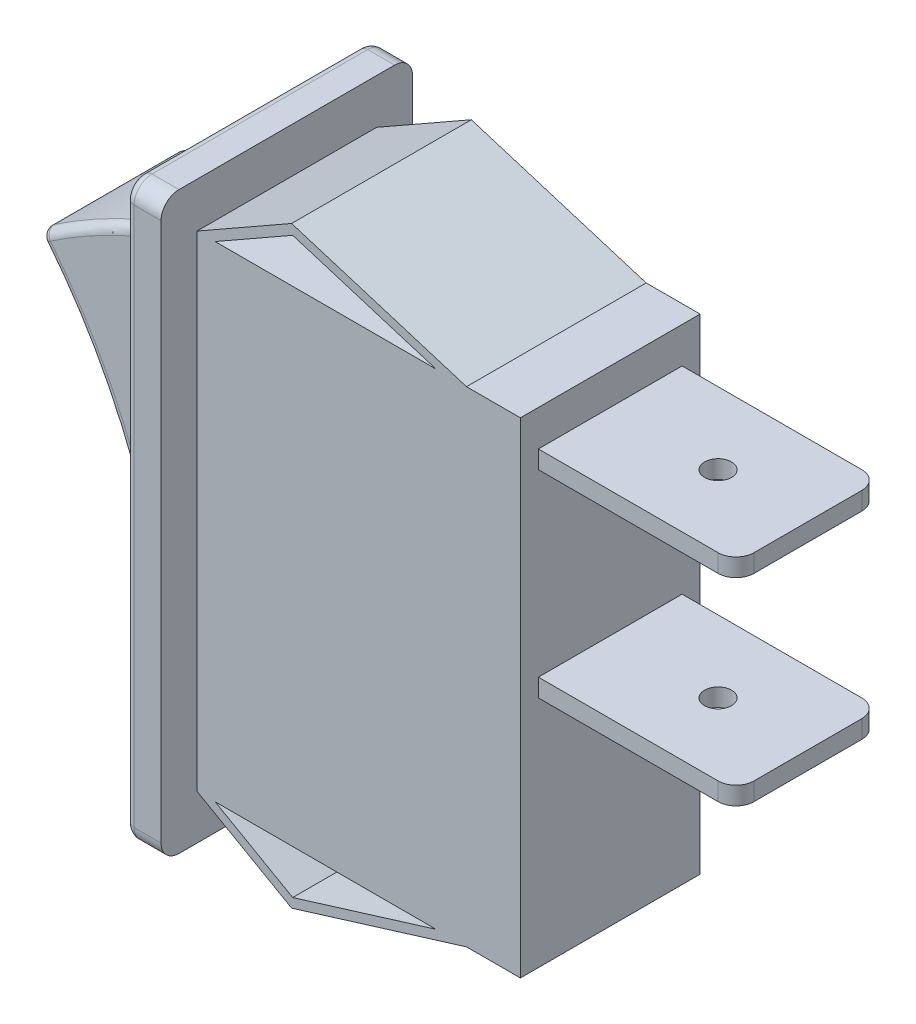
ISO-10303-21;
HEADER;
FILE_DESCRIPTION(('STEP AP214'),'2;1');
FILE_NAME('part.step','',(''),(''),'','','');
FILE_SCHEMA(('AUTOMOTIVE_DESIGN { 1 0 10303 214 1 1 1 1 }'));
ENDSEC;
DATA;
#1=APPLICATION_CONTEXT('core data for automotive mechanical design processes');
#2=APPLICATION_PROTOCOL_DEFINITION('international standard','automotive_design',2000,#1);
#3=PRODUCT_CONTEXT('',#1,'mechanical');
#4=PRODUCT('Part','Part','',(#3));
#5=PRODUCT_RELATED_PRODUCT_CATEGORY('part','',(#4));
#6=PRODUCT_DEFINITION_FORMATION('','',#4);
#7=PRODUCT_DEFINITION_CONTEXT('part definition',#1,'design');
#8=PRODUCT_DEFINITION('design','',#6,#7);
#9=PRODUCT_DEFINITION_SHAPE('','',#8);
#10=(LENGTH_UNIT() NAMED_UNIT(*) SI_UNIT(.MILLI.,.METRE.));
#11=(NAMED_UNIT(*) PLANE_ANGLE_UNIT() SI_UNIT($,.RADIAN.));
#12=(NAMED_UNIT(*) SI_UNIT($,.STERADIAN.) SOLID_ANGLE_UNIT());
#13=UNCERTAINTY_MEASURE_WITH_UNIT(LENGTH_MEASURE(1.E-05),#10,'distance_accuracy_value','');
#14=(GEOMETRIC_REPRESENTATION_CONTEXT(3) GLOBAL_UNCERTAINTY_ASSIGNED_CONTEXT((#13)) GLOBAL_UNIT_ASSIGNED_CONTEXT((#10,
#11,#12)) REPRESENTATION_CONTEXT('',''));
#15=CARTESIAN_POINT('',(0.,0.,0.));
#16=DIRECTION('',(0.,0.,1.));
#17=DIRECTION('',(1.,0.,0.));
#18=AXIS2_PLACEMENT_3D('',#15,#16,#17);
#19=CARTESIAN_POINT('',(0.,23.7520276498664,5.));
#20=DIRECTION('',(0.,0.,1.));
#21=DIRECTION('',(1.,0.,0.));
#22=AXIS2_PLACEMENT_3D('',#19,#20,#21);
#23=PLANE('',#22);
#24=DIRECTION('',(-0.955632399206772,0.294561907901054,0.));
#25=VECTOR('',#24,1.);
#26=CARTESIAN_POINT('',(-12.6732842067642,15.9584568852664,5.));
#27=LINE('',#26,#25);
#28=CARTESIAN_POINT('',(-4.69743604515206,13.5,5.));
#29=VERTEX_POINT('',#28);
#30=CARTESIAN_POINT('',(-12.6732842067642,15.9584568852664,5.));
#31=VERTEX_POINT('',#30);
#32=EDGE_CURVE('E916',#29,#31,#27,.T.);
#33=ORIENTED_EDGE('',*,*,#32,.F.);
#34=DIRECTION('',(1.,0.,0.));
#35=VECTOR('',#34,1.);
#36=CARTESIAN_POINT('',(-16.9897204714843,13.5,5.));
#37=LINE('',#36,#35);
#38=CARTESIAN_POINT('',(-16.9897204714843,13.5,5.));
#39=VERTEX_POINT('',#38);
#40=EDGE_CURVE('E913',#39,#29,#37,.T.);
#41=ORIENTED_EDGE('',*,*,#40,.F.);
#42=DIRECTION('',(-0.868942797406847,-0.494912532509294,0.));
#43=VECTOR('',#42,1.);
#44=CARTESIAN_POINT('',(-16.9897204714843,13.5,5.));
#45=LINE('',#44,#43);
#46=EDGE_CURVE('E911',#31,#39,#45,.T.);
#47=ORIENTED_EDGE('',*,*,#46,.F.);
#48=EDGE_LOOP('',(#33,#41,#47));
#49=FACE_BOUND('',#48,.T.);
#50=DIRECTION('',(-0.868942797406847,-0.494912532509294,0.));
#51=VECTOR('',#50,1.);
#52=CARTESIAN_POINT('',(-12.7327492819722,16.5,5.));
#53=LINE('',#52,#51);
#54=CARTESIAN_POINT('',(-12.7327492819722,16.5,5.));
#55=VERTEX_POINT('',#54);
#56=CARTESIAN_POINT('',(-18.,13.5,5.));
#57=VERTEX_POINT('',#56);
#58=EDGE_CURVE('E604',#55,#57,#53,.T.);
#59=ORIENTED_EDGE('',*,*,#58,.T.);
#60=DIRECTION('',(0.,-1.,0.));
#61=VECTOR('',#60,1.);
#62=CARTESIAN_POINT('',(-18.,13.5,5.));
#63=LINE('',#62,#61);
#64=CARTESIAN_POINT('',(-18.,-13.5,5.));
#65=VERTEX_POINT('',#64);
#66=EDGE_CURVE('E607',#57,#65,#63,.T.);
#67=ORIENTED_EDGE('',*,*,#66,.T.);
#68=DIRECTION('',(0.868942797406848,-0.494912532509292,0.));
#69=VECTOR('',#68,1.);
#70=CARTESIAN_POINT('',(-18.,-13.5,5.));
#71=LINE('',#70,#69);
#72=CARTESIAN_POINT('',(-12.7327492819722,-16.5,5.));
#73=VERTEX_POINT('',#72);
#74=EDGE_CURVE('E610',#65,#73,#71,.T.);
#75=ORIENTED_EDGE('',*,*,#74,.T.);
#76=DIRECTION('',(0.955632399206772,0.294561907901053,0.));
#77=VECTOR('',#76,1.);
#78=CARTESIAN_POINT('',(-12.7327492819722,-16.5,5.));
#79=LINE('',#78,#77);
#80=CARTESIAN_POINT('',(-3.,-13.5,5.));
#81=VERTEX_POINT('',#80);
#82=EDGE_CURVE('E586',#73,#81,#79,.T.);
#83=ORIENTED_EDGE('',*,*,#82,.T.);
#84=DIRECTION('',(1.,0.,0.));
#85=VECTOR('',#84,1.);
#86=CARTESIAN_POINT('',(-3.,-13.5,5.));
#87=LINE('',#86,#85);
#88=CARTESIAN_POINT('',(0.,-13.5,5.));
#89=VERTEX_POINT('',#88);
#90=EDGE_CURVE('E613',#81,#89,#87,.T.);
#91=ORIENTED_EDGE('',*,*,#90,.T.);
#92=DIRECTION('',(0.,1.,0.));
#93=VECTOR('',#92,1.);
#94=CARTESIAN_POINT('',(0.,13.5,5.));
#95=LINE('',#94,#93);
#96=CARTESIAN_POINT('',(0.,13.5,5.));
#97=VERTEX_POINT('',#96);
#98=EDGE_CURVE('E615',#89,#97,#95,.T.);
#99=ORIENTED_EDGE('',*,*,#98,.T.);
#100=DIRECTION('',(-1.,0.,0.));
#101=VECTOR('',#100,1.);
#102=CARTESIAN_POINT('',(-3.,13.5,5.));
#103=LINE('',#102,#101);
#104=CARTESIAN_POINT('',(-3.,13.5,5.));
#105=VERTEX_POINT('',#104);
#106=EDGE_CURVE('E617',#97,#105,#103,.T.);
#107=ORIENTED_EDGE('',*,*,#106,.T.);
#108=DIRECTION('',(-0.955632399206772,0.294561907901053,0.));
#109=VECTOR('',#108,1.);
#110=CARTESIAN_POINT('',(-3.,13.5,5.));
#111=LINE('',#110,#109);
#112=EDGE_CURVE('E619',#105,#55,#111,.T.);
#113=ORIENTED_EDGE('',*,*,#112,.T.);
#114=EDGE_LOOP('',(#59,#67,#75,#83,#91,#99,#107,#113));
#115=FACE_BOUND('',#114,.T.);
#116=DIRECTION('',(-1.,0.,0.));
#117=VECTOR('',#116,1.);
#118=CARTESIAN_POINT('',(-16.9897204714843,-13.5,5.));
#119=LINE('',#118,#117);
#120=CARTESIAN_POINT('',(-4.69743604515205,-13.5,5.));
#121=VERTEX_POINT('',#120);
#122=CARTESIAN_POINT('',(-16.9897204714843,-13.5,5.));
#123=VERTEX_POINT('',#122);
#124=EDGE_CURVE('E889',#121,#123,#119,.T.);
#125=ORIENTED_EDGE('',*,*,#124,.F.);
#126=DIRECTION('',(0.955632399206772,0.294561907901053,0.));
#127=VECTOR('',#126,1.);
#128=CARTESIAN_POINT('',(-4.69743604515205,-13.5,5.));
#129=LINE('',#128,#127);
#130=CARTESIAN_POINT('',(-12.6732842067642,-15.9584568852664,5.));
#131=VERTEX_POINT('',#130);
#132=EDGE_CURVE('E887',#131,#121,#129,.T.);
#133=ORIENTED_EDGE('',*,*,#132,.F.);
#134=DIRECTION('',(0.868942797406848,-0.494912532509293,0.));
#135=VECTOR('',#134,1.);
#136=CARTESIAN_POINT('',(-12.6732842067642,-15.9584568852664,5.));
#137=LINE('',#136,#135);
#138=EDGE_CURVE('E892',#123,#131,#137,.T.);
#139=ORIENTED_EDGE('',*,*,#138,.F.);
#140=EDGE_LOOP('',(#125,#133,#139));
#141=FACE_BOUND('',#140,.T.);
#142=ADVANCED_FACE('F32',(#49,#115,#141),#23,.T.);
#143=CARTESIAN_POINT('',(0.,23.7520276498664,-5.));
#144=DIRECTION('',(0.,0.,1.));
#145=DIRECTION('',(1.,0.,0.));
#146=AXIS2_PLACEMENT_3D('',#143,#144,#145);
#147=PLANE('',#146);
#148=DIRECTION('',(-0.868942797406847,-0.494912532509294,0.));
#149=VECTOR('',#148,1.);
#150=CARTESIAN_POINT('',(-16.9897204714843,13.5,-5.));
#151=LINE('',#150,#149);
#152=CARTESIAN_POINT('',(-12.6732842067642,15.9584568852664,-5.));
#153=VERTEX_POINT('',#152);
#154=CARTESIAN_POINT('',(-16.9897204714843,13.5,-5.));
#155=VERTEX_POINT('',#154);
#156=EDGE_CURVE('E902',#153,#155,#151,.T.);
#157=ORIENTED_EDGE('',*,*,#156,.T.);
#158=DIRECTION('',(1.,0.,0.));
#159=VECTOR('',#158,1.);
#160=CARTESIAN_POINT('',(-16.9897204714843,13.5,-5.));
#161=LINE('',#160,#159);
#162=CARTESIAN_POINT('',(-4.69743604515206,13.5,-5.));
#163=VERTEX_POINT('',#162);
#164=EDGE_CURVE('E905',#155,#163,#161,.T.);
#165=ORIENTED_EDGE('',*,*,#164,.T.);
#166=DIRECTION('',(-0.955632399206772,0.294561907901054,0.));
#167=VECTOR('',#166,1.);
#168=CARTESIAN_POINT('',(-12.6732842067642,15.9584568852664,-5.));
#169=LINE('',#168,#167);
#170=EDGE_CURVE('E908',#163,#153,#169,.T.);
#171=ORIENTED_EDGE('',*,*,#170,.T.);
#172=EDGE_LOOP('',(#157,#165,#171));
#173=FACE_BOUND('',#172,.T.);
#174=DIRECTION('',(-0.868942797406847,-0.494912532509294,0.));
#175=VECTOR('',#174,1.);
#176=CARTESIAN_POINT('',(-12.7327492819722,16.5,-5.));
#177=LINE('',#176,#175);
#178=CARTESIAN_POINT('',(-12.7327492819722,16.5,-5.));
#179=VERTEX_POINT('',#178);
#180=CARTESIAN_POINT('',(-18.,13.5,-5.));
#181=VERTEX_POINT('',#180);
#182=EDGE_CURVE('E926',#179,#181,#177,.T.);
#183=ORIENTED_EDGE('',*,*,#182,.F.);
#184=DIRECTION('',(-0.955632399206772,0.294561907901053,0.));
#185=VECTOR('',#184,1.);
#186=CARTESIAN_POINT('',(-3.,13.5,-5.));
#187=LINE('',#186,#185);
#188=CARTESIAN_POINT('',(-3.,13.5,-5.));
#189=VERTEX_POINT('',#188);
#190=EDGE_CURVE('E602',#189,#179,#187,.T.);
#191=ORIENTED_EDGE('',*,*,#190,.F.);
#192=DIRECTION('',(-1.,0.,0.));
#193=VECTOR('',#192,1.);
#194=CARTESIAN_POINT('',(-3.,13.5,-5.));
#195=LINE('',#194,#193);
#196=CARTESIAN_POINT('',(0.,13.5,-5.));
#197=VERTEX_POINT('',#196);
#198=EDGE_CURVE('E600',#197,#189,#195,.T.);
#199=ORIENTED_EDGE('',*,*,#198,.F.);
#200=DIRECTION('',(0.,1.,0.));
#201=VECTOR('',#200,1.);
#202=CARTESIAN_POINT('',(0.,13.5,-5.));
#203=LINE('',#202,#201);
#204=CARTESIAN_POINT('',(0.,-13.5,-5.));
#205=VERTEX_POINT('',#204);
#206=EDGE_CURVE('E595',#205,#197,#203,.T.);
#207=ORIENTED_EDGE('',*,*,#206,.F.);
#208=DIRECTION('',(1.,0.,0.));
#209=VECTOR('',#208,1.);
#210=CARTESIAN_POINT('',(-3.,-13.5,-5.));
#211=LINE('',#210,#209);
#212=CARTESIAN_POINT('',(-3.,-13.5,-5.));
#213=VERTEX_POINT('',#212);
#214=EDGE_CURVE('E593',#213,#205,#211,.T.);
#215=ORIENTED_EDGE('',*,*,#214,.F.);
#216=DIRECTION('',(0.955632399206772,0.294561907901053,0.));
#217=VECTOR('',#216,1.);
#218=CARTESIAN_POINT('',(-12.7327492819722,-16.5,-5.));
#219=LINE('',#218,#217);
#220=CARTESIAN_POINT('',(-12.7327492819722,-16.5,-5.));
#221=VERTEX_POINT('',#220);
#222=EDGE_CURVE('E581',#221,#213,#219,.T.);
#223=ORIENTED_EDGE('',*,*,#222,.F.);
#224=DIRECTION('',(0.868942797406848,-0.494912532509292,0.));
#225=VECTOR('',#224,1.);
#226=CARTESIAN_POINT('',(-18.,-13.5,-5.));
#227=LINE('',#226,#225);
#228=CARTESIAN_POINT('',(-18.,-13.5,-5.));
#229=VERTEX_POINT('',#228);
#230=EDGE_CURVE('E572',#229,#221,#227,.T.);
#231=ORIENTED_EDGE('',*,*,#230,.F.);
#232=DIRECTION('',(0.,-1.,0.));
#233=VECTOR('',#232,1.);
#234=CARTESIAN_POINT('',(-18.,13.5,-5.));
#235=LINE('',#234,#233);
#236=EDGE_CURVE('E582',#181,#229,#235,.T.);
#237=ORIENTED_EDGE('',*,*,#236,.F.);
#238=EDGE_LOOP('',(#183,#191,#199,#207,#215,#223,#231,#237));
#239=FACE_BOUND('',#238,.T.);
#240=DIRECTION('',(-1.,0.,0.));
#241=VECTOR('',#240,1.);
#242=CARTESIAN_POINT('',(-16.9897204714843,-13.5,-5.));
#243=LINE('',#242,#241);
#244=CARTESIAN_POINT('',(-4.69743604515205,-13.5,-5.));
#245=VERTEX_POINT('',#244);
#246=CARTESIAN_POINT('',(-16.9897204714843,-13.5,-5.));
#247=VERTEX_POINT('',#246);
#248=EDGE_CURVE('E881',#245,#247,#243,.T.);
#249=ORIENTED_EDGE('',*,*,#248,.T.);
#250=DIRECTION('',(0.868942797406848,-0.494912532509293,0.));
#251=VECTOR('',#250,1.);
#252=CARTESIAN_POINT('',(-12.6732842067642,-15.9584568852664,-5.));
#253=LINE('',#252,#251);
#254=CARTESIAN_POINT('',(-12.6732842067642,-15.9584568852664,-5.));
#255=VERTEX_POINT('',#254);
#256=EDGE_CURVE('E884',#247,#255,#253,.T.);
#257=ORIENTED_EDGE('',*,*,#256,.T.);
#258=DIRECTION('',(0.955632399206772,0.294561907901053,0.));
#259=VECTOR('',#258,1.);
#260=CARTESIAN_POINT('',(-4.69743604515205,-13.5,-5.));
#261=LINE('',#260,#259);
#262=EDGE_CURVE('E878',#255,#245,#261,.T.);
#263=ORIENTED_EDGE('',*,*,#262,.T.);
#264=EDGE_LOOP('',(#249,#257,#263));
#265=FACE_BOUND('',#264,.T.);
#266=ADVANCED_FACE('F537',(#173,#239,#265),#147,.F.);
#267=CARTESIAN_POINT('',(-12.7327492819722,16.5,5.));
#268=DIRECTION('',(0.494912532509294,-0.868942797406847,0.));
#269=DIRECTION('',(0.868942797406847,0.494912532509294,0.));
#270=AXIS2_PLACEMENT_3D('',#267,#268,#269);
#271=PLANE('',#270);
#272=ORIENTED_EDGE('',*,*,#182,.T.);
#273=DIRECTION('',(0.,0.,-1.));
#274=VECTOR('',#273,1.);
#275=CARTESIAN_POINT('',(-18.,13.5,5.));
#276=LINE('',#275,#274);
#277=EDGE_CURVE('E635',#57,#181,#276,.T.);
#278=ORIENTED_EDGE('',*,*,#277,.F.);
#279=ORIENTED_EDGE('',*,*,#58,.F.);
#280=DIRECTION('',(0.,0.,-1.));
#281=VECTOR('',#280,1.);
#282=CARTESIAN_POINT('',(-12.7327492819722,16.5,5.));
#283=LINE('',#282,#281);
#284=EDGE_CURVE('E621',#55,#179,#283,.T.);
#285=ORIENTED_EDGE('',*,*,#284,.T.);
#286=EDGE_LOOP('',(#272,#278,#279,#285));
#287=FACE_BOUND('',#286,.T.);
#288=ADVANCED_FACE('F34',(#287),#271,.F.);
#289=CARTESIAN_POINT('',(-18.,-13.5,5.));
#290=DIRECTION('',(0.494912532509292,0.868942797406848,0.));
#291=DIRECTION('',(-0.868942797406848,0.494912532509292,0.));
#292=AXIS2_PLACEMENT_3D('',#289,#290,#291);
#293=PLANE('',#292);
#294=ORIENTED_EDGE('',*,*,#230,.T.);
#295=DIRECTION('',(0.,0.,-1.));
#296=VECTOR('',#295,1.);
#297=CARTESIAN_POINT('',(-12.7327492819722,-16.5,5.));
#298=LINE('',#297,#296);
#299=EDGE_CURVE('E575',#73,#221,#298,.T.);
#300=ORIENTED_EDGE('',*,*,#299,.F.);
#301=ORIENTED_EDGE('',*,*,#74,.F.);
#302=DIRECTION('',(0.,0.,-1.));
#303=VECTOR('',#302,1.);
#304=CARTESIAN_POINT('',(-18.,-13.5,5.));
#305=LINE('',#304,#303);
#306=EDGE_CURVE('E577',#65,#229,#305,.T.);
#307=ORIENTED_EDGE('',*,*,#306,.T.);
#308=EDGE_LOOP('',(#294,#300,#301,#307));
#309=FACE_BOUND('',#308,.T.);
#310=ADVANCED_FACE('F561',(#309),#293,.F.);
#311=CARTESIAN_POINT('',(-12.7327492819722,-16.5,5.));
#312=DIRECTION('',(-0.294561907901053,0.955632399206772,0.));
#313=DIRECTION('',(-0.955632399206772,-0.294561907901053,0.));
#314=AXIS2_PLACEMENT_3D('',#311,#312,#313);
#315=PLANE('',#314);
#316=ORIENTED_EDGE('',*,*,#222,.T.);
#317=DIRECTION('',(0.,0.,-1.));
#318=VECTOR('',#317,1.);
#319=CARTESIAN_POINT('',(-3.,-13.5,5.));
#320=LINE('',#319,#318);
#321=EDGE_CURVE('E587',#81,#213,#320,.T.);
#322=ORIENTED_EDGE('',*,*,#321,.F.);
#323=ORIENTED_EDGE('',*,*,#82,.F.);
#324=ORIENTED_EDGE('',*,*,#299,.T.);
#325=EDGE_LOOP('',(#316,#322,#323,#324));
#326=FACE_BOUND('',#325,.T.);
#327=ADVANCED_FACE('F558',(#326),#315,.F.);
#328=CARTESIAN_POINT('',(-3.,-13.5,5.));
#329=DIRECTION('',(0.,1.,0.));
#330=DIRECTION('',(-1.,0.,0.));
#331=AXIS2_PLACEMENT_3D('',#328,#329,#330);
#332=PLANE('',#331);
#333=ORIENTED_EDGE('',*,*,#214,.T.);
#334=DIRECTION('',(0.,0.,-1.));
#335=VECTOR('',#334,1.);
#336=CARTESIAN_POINT('',(0.,-13.5,5.));
#337=LINE('',#336,#335);
#338=EDGE_CURVE('E630',#89,#205,#337,.T.);
#339=ORIENTED_EDGE('',*,*,#338,.F.);
#340=ORIENTED_EDGE('',*,*,#90,.F.);
#341=ORIENTED_EDGE('',*,*,#321,.T.);
#342=EDGE_LOOP('',(#333,#339,#340,#341));
#343=FACE_BOUND('',#342,.T.);
#344=ADVANCED_FACE('F554',(#343),#332,.F.);
#345=CARTESIAN_POINT('',(0.,13.5,5.));
#346=DIRECTION('',(-1.,0.,0.));
#347=DIRECTION('',(0.,-1.,0.));
#348=AXIS2_PLACEMENT_3D('',#345,#346,#347);
#349=PLANE('',#348);
#350=DIRECTION('',(0.,0.,-1.));
#351=VECTOR('',#350,1.);
#352=CARTESIAN_POINT('',(0.,-0.500000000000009,5.));
#353=LINE('',#352,#351);
#354=CARTESIAN_POINT('',(0.,-0.500000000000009,4.));
#355=VERTEX_POINT('',#354);
#356=CARTESIAN_POINT('',(0.,-0.500000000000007,-4.));
#357=VERTEX_POINT('',#356);
#358=EDGE_CURVE('E687',#355,#357,#353,.T.);
#359=ORIENTED_EDGE('',*,*,#358,.F.);
#360=DIRECTION('',(0.,1.,0.));
#361=VECTOR('',#360,1.);
#362=CARTESIAN_POINT('',(0.,13.5,4.));
#363=LINE('',#362,#361);
#364=CARTESIAN_POINT('',(0.,0.499999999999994,4.));
#365=VERTEX_POINT('',#364);
#366=EDGE_CURVE('E815',#355,#365,#363,.T.);
#367=ORIENTED_EDGE('',*,*,#366,.T.);
#368=DIRECTION('',(0.,0.,1.));
#369=VECTOR('',#368,1.);
#370=CARTESIAN_POINT('',(0.,0.499999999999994,5.));
#371=LINE('',#370,#369);
#372=CARTESIAN_POINT('',(0.,0.499999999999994,-4.));
#373=VERTEX_POINT('',#372);
#374=EDGE_CURVE('E690',#373,#365,#371,.T.);
#375=ORIENTED_EDGE('',*,*,#374,.F.);
#376=DIRECTION('',(0.,1.,0.));
#377=VECTOR('',#376,1.);
#378=CARTESIAN_POINT('',(0.,13.5,-4.));
#379=LINE('',#378,#377);
#380=EDGE_CURVE('E811',#357,#373,#379,.T.);
#381=ORIENTED_EDGE('',*,*,#380,.F.);
#382=EDGE_LOOP('',(#359,#367,#375,#381));
#383=FACE_BOUND('',#382,.T.);
#384=DIRECTION('',(0.,0.,-1.));
#385=VECTOR('',#384,1.);
#386=CARTESIAN_POINT('',(0.,10.5,5.));
#387=LINE('',#386,#385);
#388=CARTESIAN_POINT('',(0.,10.5,4.));
#389=VERTEX_POINT('',#388);
#390=CARTESIAN_POINT('',(0.,10.5,-4.));
#391=VERTEX_POINT('',#390);
#392=EDGE_CURVE('E684',#389,#391,#387,.T.);
#393=ORIENTED_EDGE('',*,*,#392,.F.);
#394=CARTESIAN_POINT('',(0.,11.5,4.));
#395=VERTEX_POINT('',#394);
#396=EDGE_CURVE('E812',#389,#395,#363,.T.);
#397=ORIENTED_EDGE('',*,*,#396,.T.);
#398=DIRECTION('',(0.,0.,1.));
#399=VECTOR('',#398,1.);
#400=CARTESIAN_POINT('',(0.,11.5,5.));
#401=LINE('',#400,#399);
#402=CARTESIAN_POINT('',(0.,11.5,-4.));
#403=VERTEX_POINT('',#402);
#404=EDGE_CURVE('E681',#403,#395,#401,.T.);
#405=ORIENTED_EDGE('',*,*,#404,.F.);
#406=EDGE_CURVE('E808',#391,#403,#379,.T.);
#407=ORIENTED_EDGE('',*,*,#406,.F.);
#408=EDGE_LOOP('',(#393,#397,#405,#407));
#409=FACE_BOUND('',#408,.T.);
#410=ORIENTED_EDGE('',*,*,#206,.T.);
#411=DIRECTION('',(0.,0.,-1.));
#412=VECTOR('',#411,1.);
#413=CARTESIAN_POINT('',(0.,13.5,5.));
#414=LINE('',#413,#412);
#415=EDGE_CURVE('E627',#97,#197,#414,.T.);
#416=ORIENTED_EDGE('',*,*,#415,.F.);
#417=ORIENTED_EDGE('',*,*,#98,.F.);
#418=ORIENTED_EDGE('',*,*,#338,.T.);
#419=EDGE_LOOP('',(#410,#416,#417,#418));
#420=FACE_BOUND('',#419,.T.);
#421=ADVANCED_FACE('F550',(#383,#409,#420),#349,.F.);
#422=CARTESIAN_POINT('',(-3.,13.5,5.));
#423=DIRECTION('',(0.,-1.,0.));
#424=DIRECTION('',(1.,0.,0.));
#425=AXIS2_PLACEMENT_3D('',#422,#423,#424);
#426=PLANE('',#425);
#427=ORIENTED_EDGE('',*,*,#198,.T.);
#428=DIRECTION('',(0.,0.,-1.));
#429=VECTOR('',#428,1.);
#430=CARTESIAN_POINT('',(-3.,13.5,5.));
#431=LINE('',#430,#429);
#432=EDGE_CURVE('E624',#105,#189,#431,.T.);
#433=ORIENTED_EDGE('',*,*,#432,.F.);
#434=ORIENTED_EDGE('',*,*,#106,.F.);
#435=ORIENTED_EDGE('',*,*,#415,.T.);
#436=EDGE_LOOP('',(#427,#433,#434,#435));
#437=FACE_BOUND('',#436,.T.);
#438=ADVANCED_FACE('F546',(#437),#426,.F.);
#439=CARTESIAN_POINT('',(-3.,13.5,5.));
#440=DIRECTION('',(-0.294561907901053,-0.955632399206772,0.));
#441=DIRECTION('',(0.955632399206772,-0.294561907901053,0.));
#442=AXIS2_PLACEMENT_3D('',#439,#440,#441);
#443=PLANE('',#442);
#444=ORIENTED_EDGE('',*,*,#190,.T.);
#445=ORIENTED_EDGE('',*,*,#284,.F.);
#446=ORIENTED_EDGE('',*,*,#112,.F.);
#447=ORIENTED_EDGE('',*,*,#432,.T.);
#448=EDGE_LOOP('',(#444,#445,#446,#447));
#449=FACE_BOUND('',#448,.T.);
#450=ADVANCED_FACE('F535',(#449),#443,.F.);
#451=CARTESIAN_POINT('',(-16.9897204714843,13.5,5.));
#452=DIRECTION('',(0.494912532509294,-0.868942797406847,0.));
#453=DIRECTION('',(0.868942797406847,0.494912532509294,0.));
#454=AXIS2_PLACEMENT_3D('',#451,#452,#453);
#455=PLANE('',#454);
#456=ORIENTED_EDGE('',*,*,#156,.F.);
#457=DIRECTION('',(0.,0.,-1.));
#458=VECTOR('',#457,1.);
#459=CARTESIAN_POINT('',(-12.6732842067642,15.9584568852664,5.));
#460=LINE('',#459,#458);
#461=EDGE_CURVE('E918',#31,#153,#460,.T.);
#462=ORIENTED_EDGE('',*,*,#461,.F.);
#463=ORIENTED_EDGE('',*,*,#46,.T.);
#464=DIRECTION('',(0.,0.,-1.));
#465=VECTOR('',#464,1.);
#466=CARTESIAN_POINT('',(-16.9897204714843,13.5,5.));
#467=LINE('',#466,#465);
#468=EDGE_CURVE('E923',#39,#155,#467,.T.);
#469=ORIENTED_EDGE('',*,*,#468,.T.);
#470=EDGE_LOOP('',(#456,#462,#463,#469));
#471=FACE_BOUND('',#470,.T.);
#472=ADVANCED_FACE('F531',(#471),#455,.T.);
#473=CARTESIAN_POINT('',(-16.9897204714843,13.5,5.));
#474=DIRECTION('',(0.,1.,0.));
#475=DIRECTION('',(-1.,0.,0.));
#476=AXIS2_PLACEMENT_3D('',#473,#474,#475);
#477=PLANE('',#476);
#478=ORIENTED_EDGE('',*,*,#164,.F.);
#479=ORIENTED_EDGE('',*,*,#468,.F.);
#480=ORIENTED_EDGE('',*,*,#40,.T.);
#481=DIRECTION('',(0.,0.,-1.));
#482=VECTOR('',#481,1.);
#483=CARTESIAN_POINT('',(-4.69743604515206,13.5,5.));
#484=LINE('',#483,#482);
#485=EDGE_CURVE('E921',#29,#163,#484,.T.);
#486=ORIENTED_EDGE('',*,*,#485,.T.);
#487=EDGE_LOOP('',(#478,#479,#480,#486));
#488=FACE_BOUND('',#487,.T.);
#489=ADVANCED_FACE('F527',(#488),#477,.T.);
#490=CARTESIAN_POINT('',(-12.6732842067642,15.9584568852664,5.));
#491=DIRECTION('',(-0.294561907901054,-0.955632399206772,0.));
#492=DIRECTION('',(0.955632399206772,-0.294561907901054,0.));
#493=AXIS2_PLACEMENT_3D('',#490,#491,#492);
#494=PLANE('',#493);
#495=ORIENTED_EDGE('',*,*,#170,.F.);
#496=ORIENTED_EDGE('',*,*,#485,.F.);
#497=ORIENTED_EDGE('',*,*,#32,.T.);
#498=ORIENTED_EDGE('',*,*,#461,.T.);
#499=EDGE_LOOP('',(#495,#496,#497,#498));
#500=FACE_BOUND('',#499,.T.);
#501=ADVANCED_FACE('F523',(#500),#494,.T.);
#502=CARTESIAN_POINT('',(-4.69743604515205,-13.5,5.));
#503=DIRECTION('',(-0.294561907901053,0.955632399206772,0.));
#504=DIRECTION('',(-0.955632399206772,-0.294561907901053,0.));
#505=AXIS2_PLACEMENT_3D('',#502,#503,#504);
#506=PLANE('',#505);
#507=ORIENTED_EDGE('',*,*,#262,.F.);
#508=DIRECTION('',(0.,0.,-1.));
#509=VECTOR('',#508,1.);
#510=CARTESIAN_POINT('',(-12.6732842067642,-15.9584568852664,5.));
#511=LINE('',#510,#509);
#512=EDGE_CURVE('E894',#131,#255,#511,.T.);
#513=ORIENTED_EDGE('',*,*,#512,.F.);
#514=ORIENTED_EDGE('',*,*,#132,.T.);
#515=DIRECTION('',(0.,0.,-1.));
#516=VECTOR('',#515,1.);
#517=CARTESIAN_POINT('',(-4.69743604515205,-13.5,5.));
#518=LINE('',#517,#516);
#519=EDGE_CURVE('E899',#121,#245,#518,.T.);
#520=ORIENTED_EDGE('',*,*,#519,.T.);
#521=EDGE_LOOP('',(#507,#513,#514,#520));
#522=FACE_BOUND('',#521,.T.);
#523=ADVANCED_FACE('F519',(#522),#506,.T.);
#524=CARTESIAN_POINT('',(-16.9897204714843,-13.5,5.));
#525=DIRECTION('',(0.,-1.,0.));
#526=DIRECTION('',(0.,0.,-1.));
#527=AXIS2_PLACEMENT_3D('',#524,#525,#526);
#528=PLANE('',#527);
#529=ORIENTED_EDGE('',*,*,#248,.F.);
#530=ORIENTED_EDGE('',*,*,#519,.F.);
#531=ORIENTED_EDGE('',*,*,#124,.T.);
#532=DIRECTION('',(0.,0.,-1.));
#533=VECTOR('',#532,1.);
#534=CARTESIAN_POINT('',(-16.9897204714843,-13.5,5.));
#535=LINE('',#534,#533);
#536=EDGE_CURVE('E897',#123,#247,#535,.T.);
#537=ORIENTED_EDGE('',*,*,#536,.T.);
#538=EDGE_LOOP('',(#529,#530,#531,#537));
#539=FACE_BOUND('',#538,.T.);
#540=ADVANCED_FACE('F515',(#539),#528,.T.);
#541=CARTESIAN_POINT('',(-12.6732842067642,-15.9584568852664,5.));
#542=DIRECTION('',(0.494912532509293,0.868942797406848,0.));
#543=DIRECTION('',(-0.868942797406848,0.494912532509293,0.));
#544=AXIS2_PLACEMENT_3D('',#541,#542,#543);
#545=PLANE('',#544);
#546=ORIENTED_EDGE('',*,*,#256,.F.);
#547=ORIENTED_EDGE('',*,*,#536,.F.);
#548=ORIENTED_EDGE('',*,*,#138,.T.);
#549=ORIENTED_EDGE('',*,*,#512,.T.);
#550=EDGE_LOOP('',(#546,#547,#548,#549));
#551=FACE_BOUND('',#550,.T.);
#552=ADVANCED_FACE('F512',(#551),#545,.T.);
#553=CARTESIAN_POINT('',(-18.,15.,-6.));
#554=DIRECTION('',(1.,0.,0.));
#555=DIRECTION('',(0.,1.,0.));
#556=AXIS2_PLACEMENT_3D('',#553,#554,#555);
#557=PLANE('',#556);
#558=CARTESIAN_POINT('',(-18.,15.,-6.));
#559=DIRECTION('',(-1.,0.,0.));
#560=DIRECTION('',(0.,1.,0.));
#561=AXIS2_PLACEMENT_3D('',#558,#559,#560);
#562=CIRCLE('',#561,1.);
#563=CARTESIAN_POINT('',(-18.,16.,-5.99999999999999));
#564=VERTEX_POINT('',#563);
#565=CARTESIAN_POINT('',(-18.,15.,-7.));
#566=VERTEX_POINT('',#565);
#567=EDGE_CURVE('E838',#564,#566,#562,.T.);
#568=ORIENTED_EDGE('',*,*,#567,.F.);
#569=DIRECTION('',(0.,0.,-1.));
#570=VECTOR('',#569,1.);
#571=CARTESIAN_POINT('',(-18.,16.,5.99999999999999));
#572=LINE('',#571,#570);
#573=CARTESIAN_POINT('',(-18.,16.,5.99999999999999));
#574=VERTEX_POINT('',#573);
#575=EDGE_CURVE('E859',#574,#564,#572,.T.);
#576=ORIENTED_EDGE('',*,*,#575,.F.);
#577=CARTESIAN_POINT('',(-18.,15.,6.));
#578=DIRECTION('',(-1.,0.,0.));
#579=DIRECTION('',(0.,-1.,0.));
#580=AXIS2_PLACEMENT_3D('',#577,#578,#579);
#581=CIRCLE('',#580,1.);
#582=CARTESIAN_POINT('',(-18.,15.,7.));
#583=VERTEX_POINT('',#582);
#584=EDGE_CURVE('E856',#583,#574,#581,.T.);
#585=ORIENTED_EDGE('',*,*,#584,.F.);
#586=DIRECTION('',(0.,1.,0.));
#587=VECTOR('',#586,1.);
#588=CARTESIAN_POINT('',(-18.,15.,7.));
#589=LINE('',#588,#587);
#590=CARTESIAN_POINT('',(-18.,-15.,7.));
#591=VERTEX_POINT('',#590);
#592=EDGE_CURVE('E853',#591,#583,#589,.T.);
#593=ORIENTED_EDGE('',*,*,#592,.F.);
#594=CARTESIAN_POINT('',(-18.,-15.,6.));
#595=DIRECTION('',(-1.,0.,0.));
#596=DIRECTION('',(0.,1.,0.));
#597=AXIS2_PLACEMENT_3D('',#594,#595,#596);
#598=CIRCLE('',#597,0.999999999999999);
#599=CARTESIAN_POINT('',(-18.,-16.,6.));
#600=VERTEX_POINT('',#599);
#601=EDGE_CURVE('E850',#600,#591,#598,.T.);
#602=ORIENTED_EDGE('',*,*,#601,.F.);
#603=DIRECTION('',(0.,0.,1.));
#604=VECTOR('',#603,1.);
#605=CARTESIAN_POINT('',(-18.,-16.,6.));
#606=LINE('',#605,#604);
#607=CARTESIAN_POINT('',(-18.,-16.,-5.99999999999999));
#608=VERTEX_POINT('',#607);
#609=EDGE_CURVE('E847',#608,#600,#606,.T.);
#610=ORIENTED_EDGE('',*,*,#609,.F.);
#611=CARTESIAN_POINT('',(-18.,-15.,-6.));
#612=DIRECTION('',(-1.,0.,0.));
#613=DIRECTION('',(0.,1.,0.));
#614=AXIS2_PLACEMENT_3D('',#611,#612,#613);
#615=CIRCLE('',#614,1.);
#616=CARTESIAN_POINT('',(-18.,-15.,-7.));
#617=VERTEX_POINT('',#616);
#618=EDGE_CURVE('E844',#617,#608,#615,.T.);
#619=ORIENTED_EDGE('',*,*,#618,.F.);
#620=DIRECTION('',(0.,-1.,0.));
#621=VECTOR('',#620,1.);
#622=CARTESIAN_POINT('',(-18.,15.,-7.));
#623=LINE('',#622,#621);
#624=EDGE_CURVE('E841',#566,#617,#623,.T.);
#625=ORIENTED_EDGE('',*,*,#624,.F.);
#626=EDGE_LOOP('',(#568,#576,#585,#593,#602,#610,#619,#625));
#627=FACE_BOUND('',#626,.T.);
#628=ORIENTED_EDGE('',*,*,#277,.T.);
#629=ORIENTED_EDGE('',*,*,#236,.T.);
#630=ORIENTED_EDGE('',*,*,#306,.F.);
#631=ORIENTED_EDGE('',*,*,#66,.F.);
#632=EDGE_LOOP('',(#628,#629,#630,#631));
#633=FACE_BOUND('',#632,.T.);
#634=ADVANCED_FACE('F478',(#627,#633),#557,.T.);
#635=CARTESIAN_POINT('',(-20.,15.,-6.));
#636=DIRECTION('',(1.,0.,0.));
#637=DIRECTION('',(0.,1.,0.));
#638=AXIS2_PLACEMENT_3D('',#635,#636,#637);
#639=CYLINDRICAL_SURFACE('',#638,1.);
#640=DIRECTION('',(1.,0.,0.));
#641=VECTOR('',#640,1.);
#642=CARTESIAN_POINT('',(-20.,15.,-7.));
#643=LINE('',#642,#641);
#644=CARTESIAN_POINT('',(-19.5,15.,-7.));
#645=VERTEX_POINT('',#644);
#646=EDGE_CURVE('E876',#645,#566,#643,.T.);
#647=ORIENTED_EDGE('',*,*,#646,.F.);
#648=CARTESIAN_POINT('',(-19.5,15.,-6.));
#649=DIRECTION('',(1.,0.,0.));
#650=DIRECTION('',(0.,1.,0.));
#651=AXIS2_PLACEMENT_3D('',#648,#649,#650);
#652=CIRCLE('',#651,1.);
#653=CARTESIAN_POINT('',(-19.5,16.,-5.99999999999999));
#654=VERTEX_POINT('',#653);
#655=EDGE_CURVE('E669',#645,#654,#652,.T.);
#656=ORIENTED_EDGE('',*,*,#655,.T.);
#657=DIRECTION('',(1.,0.,0.));
#658=VECTOR('',#657,1.);
#659=CARTESIAN_POINT('',(-20.,16.,-5.99999999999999));
#660=LINE('',#659,#658);
#661=EDGE_CURVE('E862',#654,#564,#660,.T.);
#662=ORIENTED_EDGE('',*,*,#661,.T.);
#663=ORIENTED_EDGE('',*,*,#567,.T.);
#664=EDGE_LOOP('',(#647,#656,#662,#663));
#665=FACE_BOUND('',#664,.T.);
#666=ADVANCED_FACE('F507',(#665),#639,.T.);
#667=CARTESIAN_POINT('',(-20.,15.,-7.));
#668=DIRECTION('',(0.,0.,1.));
#669=DIRECTION('',(0.,-1.,0.));
#670=AXIS2_PLACEMENT_3D('',#667,#668,#669);
#671=PLANE('',#670);
#672=DIRECTION('',(1.,0.,0.));
#673=VECTOR('',#672,1.);
#674=CARTESIAN_POINT('',(-20.,-15.,-7.));
#675=LINE('',#674,#673);
#676=CARTESIAN_POINT('',(-19.5,-15.,-7.));
#677=VERTEX_POINT('',#676);
#678=EDGE_CURVE('E874',#677,#617,#675,.T.);
#679=ORIENTED_EDGE('',*,*,#678,.F.);
#680=DIRECTION('',(0.,-1.,0.));
#681=VECTOR('',#680,1.);
#682=CARTESIAN_POINT('',(-19.5,15.,-7.));
#683=LINE('',#682,#681);
#684=EDGE_CURVE('E667',#677,#645,#683,.F.);
#685=ORIENTED_EDGE('',*,*,#684,.T.);
#686=ORIENTED_EDGE('',*,*,#646,.T.);
#687=ORIENTED_EDGE('',*,*,#624,.T.);
#688=EDGE_LOOP('',(#679,#685,#686,#687));
#689=FACE_BOUND('',#688,.T.);
#690=ADVANCED_FACE('F503',(#689),#671,.F.);
#691=CARTESIAN_POINT('',(-20.,-15.,-6.));
#692=DIRECTION('',(1.,0.,0.));
#693=DIRECTION('',(0.,1.,0.));
#694=AXIS2_PLACEMENT_3D('',#691,#692,#693);
#695=CYLINDRICAL_SURFACE('',#694,1.);
#696=DIRECTION('',(1.,0.,0.));
#697=VECTOR('',#696,1.);
#698=CARTESIAN_POINT('',(-20.,-16.,-5.99999999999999));
#699=LINE('',#698,#697);
#700=CARTESIAN_POINT('',(-19.5,-16.,-5.99999999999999));
#701=VERTEX_POINT('',#700);
#702=EDGE_CURVE('E872',#701,#608,#699,.T.);
#703=ORIENTED_EDGE('',*,*,#702,.F.);
#704=CARTESIAN_POINT('',(-19.5,-15.,-6.));
#705=DIRECTION('',(1.,0.,0.));
#706=DIRECTION('',(0.,1.,0.));
#707=AXIS2_PLACEMENT_3D('',#704,#705,#706);
#708=CIRCLE('',#707,1.);
#709=EDGE_CURVE('E665',#701,#677,#708,.T.);
#710=ORIENTED_EDGE('',*,*,#709,.T.);
#711=ORIENTED_EDGE('',*,*,#678,.T.);
#712=ORIENTED_EDGE('',*,*,#618,.T.);
#713=EDGE_LOOP('',(#703,#710,#711,#712));
#714=FACE_BOUND('',#713,.T.);
#715=ADVANCED_FACE('F499',(#714),#695,.T.);
#716=CARTESIAN_POINT('',(-20.,-16.,6.));
#717=DIRECTION('',(0.,1.,0.));
#718=DIRECTION('',(-1.,0.,0.));
#719=AXIS2_PLACEMENT_3D('',#716,#717,#718);
#720=PLANE('',#719);
#721=DIRECTION('',(1.,0.,0.));
#722=VECTOR('',#721,1.);
#723=CARTESIAN_POINT('',(-20.,-16.,6.));
#724=LINE('',#723,#722);
#725=CARTESIAN_POINT('',(-19.5,-16.,6.));
#726=VERTEX_POINT('',#725);
#727=EDGE_CURVE('E870',#726,#600,#724,.T.);
#728=ORIENTED_EDGE('',*,*,#727,.F.);
#729=DIRECTION('',(0.,0.,1.));
#730=VECTOR('',#729,1.);
#731=CARTESIAN_POINT('',(-19.5,-16.,6.));
#732=LINE('',#731,#730);
#733=EDGE_CURVE('E663',#726,#701,#732,.F.);
#734=ORIENTED_EDGE('',*,*,#733,.T.);
#735=ORIENTED_EDGE('',*,*,#702,.T.);
#736=ORIENTED_EDGE('',*,*,#609,.T.);
#737=EDGE_LOOP('',(#728,#734,#735,#736));
#738=FACE_BOUND('',#737,.T.);
#739=ADVANCED_FACE('F495',(#738),#720,.F.);
#740=CARTESIAN_POINT('',(-20.,-15.,6.));
#741=DIRECTION('',(1.,0.,0.));
#742=DIRECTION('',(0.,1.,0.));
#743=AXIS2_PLACEMENT_3D('',#740,#741,#742);
#744=CYLINDRICAL_SURFACE('',#743,0.999999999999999);
#745=DIRECTION('',(1.,0.,0.));
#746=VECTOR('',#745,1.);
#747=CARTESIAN_POINT('',(-20.,-15.,7.));
#748=LINE('',#747,#746);
#749=CARTESIAN_POINT('',(-19.5,-15.,7.));
#750=VERTEX_POINT('',#749);
#751=EDGE_CURVE('E868',#750,#591,#748,.T.);
#752=ORIENTED_EDGE('',*,*,#751,.F.);
#753=CARTESIAN_POINT('',(-19.5,-15.,6.));
#754=DIRECTION('',(1.,0.,0.));
#755=DIRECTION('',(0.,1.,0.));
#756=AXIS2_PLACEMENT_3D('',#753,#754,#755);
#757=CIRCLE('',#756,0.999999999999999);
#758=EDGE_CURVE('E661',#750,#726,#757,.T.);
#759=ORIENTED_EDGE('',*,*,#758,.T.);
#760=ORIENTED_EDGE('',*,*,#727,.T.);
#761=ORIENTED_EDGE('',*,*,#601,.T.);
#762=EDGE_LOOP('',(#752,#759,#760,#761));
#763=FACE_BOUND('',#762,.T.);
#764=ADVANCED_FACE('F491',(#763),#744,.T.);
#765=CARTESIAN_POINT('',(-20.,15.,7.));
#766=DIRECTION('',(0.,0.,-1.));
#767=DIRECTION('',(0.,1.,0.));
#768=AXIS2_PLACEMENT_3D('',#765,#766,#767);
#769=PLANE('',#768);
#770=DIRECTION('',(1.,0.,0.));
#771=VECTOR('',#770,1.);
#772=CARTESIAN_POINT('',(-20.,15.,7.));
#773=LINE('',#772,#771);
#774=CARTESIAN_POINT('',(-19.5,15.,7.));
#775=VERTEX_POINT('',#774);
#776=EDGE_CURVE('E866',#775,#583,#773,.T.);
#777=ORIENTED_EDGE('',*,*,#776,.F.);
#778=DIRECTION('',(0.,1.,0.));
#779=VECTOR('',#778,1.);
#780=CARTESIAN_POINT('',(-19.5,15.,7.));
#781=LINE('',#780,#779);
#782=EDGE_CURVE('E659',#775,#750,#781,.F.);
#783=ORIENTED_EDGE('',*,*,#782,.T.);
#784=ORIENTED_EDGE('',*,*,#751,.T.);
#785=ORIENTED_EDGE('',*,*,#592,.T.);
#786=EDGE_LOOP('',(#777,#783,#784,#785));
#787=FACE_BOUND('',#786,.T.);
#788=ADVANCED_FACE('F487',(#787),#769,.F.);
#789=CARTESIAN_POINT('',(-20.,15.,6.));
#790=DIRECTION('',(1.,0.,0.));
#791=DIRECTION('',(0.,1.,0.));
#792=AXIS2_PLACEMENT_3D('',#789,#790,#791);
#793=CYLINDRICAL_SURFACE('',#792,1.);
#794=DIRECTION('',(1.,0.,0.));
#795=VECTOR('',#794,1.);
#796=CARTESIAN_POINT('',(-20.,16.,5.99999999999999));
#797=LINE('',#796,#795);
#798=CARTESIAN_POINT('',(-19.5,16.,5.99999999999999));
#799=VERTEX_POINT('',#798);
#800=EDGE_CURVE('E864',#799,#574,#797,.T.);
#801=ORIENTED_EDGE('',*,*,#800,.F.);
#802=CARTESIAN_POINT('',(-19.5,15.,6.));
#803=DIRECTION('',(1.,0.,0.));
#804=DIRECTION('',(0.,1.,0.));
#805=AXIS2_PLACEMENT_3D('',#802,#803,#804);
#806=CIRCLE('',#805,1.);
#807=EDGE_CURVE('E657',#799,#775,#806,.T.);
#808=ORIENTED_EDGE('',*,*,#807,.T.);
#809=ORIENTED_EDGE('',*,*,#776,.T.);
#810=ORIENTED_EDGE('',*,*,#584,.T.);
#811=EDGE_LOOP('',(#801,#808,#809,#810));
#812=FACE_BOUND('',#811,.T.);
#813=ADVANCED_FACE('F483',(#812),#793,.T.);
#814=CARTESIAN_POINT('',(-20.,16.,5.99999999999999));
#815=DIRECTION('',(0.,-1.,0.));
#816=DIRECTION('',(1.,0.,0.));
#817=AXIS2_PLACEMENT_3D('',#814,#815,#816);
#818=PLANE('',#817);
#819=ORIENTED_EDGE('',*,*,#661,.F.);
#820=DIRECTION('',(0.,0.,-1.));
#821=VECTOR('',#820,1.);
#822=CARTESIAN_POINT('',(-19.5,16.,5.99999999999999));
#823=LINE('',#822,#821);
#824=EDGE_CURVE('E654',#654,#799,#823,.F.);
#825=ORIENTED_EDGE('',*,*,#824,.T.);
#826=ORIENTED_EDGE('',*,*,#800,.T.);
#827=ORIENTED_EDGE('',*,*,#575,.T.);
#828=EDGE_LOOP('',(#819,#825,#826,#827));
#829=FACE_BOUND('',#828,.T.);
#830=ADVANCED_FACE('F476',(#829),#818,.F.);
#831=CARTESIAN_POINT('',(-20.,15.,-6.));
#832=DIRECTION('',(1.,0.,0.));
#833=DIRECTION('',(0.,1.,0.));
#834=AXIS2_PLACEMENT_3D('',#831,#832,#833);
#835=PLANE('',#834);
#836=DIRECTION('',(0.,0.,-1.));
#837=VECTOR('',#836,1.);
#838=CARTESIAN_POINT('',(-20.,12.,4.));
#839=LINE('',#838,#837);
#840=CARTESIAN_POINT('',(-20.,12.,3.5));
#841=VERTEX_POINT('',#840);
#842=CARTESIAN_POINT('',(-20.,12.,-3.5));
#843=VERTEX_POINT('',#842);
#844=EDGE_CURVE('E673',#841,#843,#839,.T.);
#845=ORIENTED_EDGE('',*,*,#844,.F.);
#846=CARTESIAN_POINT('',(-20.,12.,3.5));
#847=CARTESIAN_POINT('',(-20.,12.0000294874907,3.52711077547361));
#848=CARTESIAN_POINT('',(-20.,11.9976809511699,3.55420631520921));
#849=CARTESIAN_POINT('',(-20.,11.988455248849,3.60755735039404));
#850=CARTESIAN_POINT('',(-20.,11.9815878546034,3.63381453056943));
#851=CARTESIAN_POINT('',(-20.,11.9635501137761,3.68480253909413));
#852=CARTESIAN_POINT('',(-20.,11.9523797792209,3.70953337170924));
#853=CARTESIAN_POINT('',(-20.,11.926129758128,3.75682462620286));
#854=CARTESIAN_POINT('',(-20.,11.9110492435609,3.77938458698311));
#855=CARTESIAN_POINT('',(-20.,11.8771103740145,3.8222279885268));
#856=CARTESIAN_POINT('',(-20.,11.8581797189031,3.84245406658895));
#857=CARTESIAN_POINT('',(-20.,11.8173278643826,3.87961766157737));
#858=CARTESIAN_POINT('',(-20.,11.7954059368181,3.89655437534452));
#859=CARTESIAN_POINT('',(-20.,11.7480905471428,3.92751368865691));
#860=CARTESIAN_POINT('',(-20.,11.7225816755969,3.94135974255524));
#861=CARTESIAN_POINT('',(-20.,11.6696759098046,3.96479434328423));
#862=CARTESIAN_POINT('',(-20.,11.6422787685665,3.97438233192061));
#863=CARTESIAN_POINT('',(-20.,11.5912932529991,3.98782075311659));
#864=CARTESIAN_POINT('',(-20.,11.5678900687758,3.99238675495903));
#865=CARTESIAN_POINT('',(-20.,11.5207261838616,3.9984765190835));
#866=CARTESIAN_POINT('',(-20.,11.4969660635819,4.00000477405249));
#867=CARTESIAN_POINT('',(-20.,11.4732014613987,4.));
#868=B_SPLINE_CURVE_WITH_KNOTS('',3,(#846,#847,#848,#849,#850,#851,#852,#853,#854,#855,#856,
#857,#858,#859,#860,#861,#862,#863,#864,#865,#866,#867),.UNSPECIFIED.,.F.,.F.,(4,2,2,2,2,2,2,2,
2,2,4),(0.,0.0812074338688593,0.162239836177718,0.243272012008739,0.324321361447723,
0.407062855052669,0.489824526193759,0.576515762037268,0.663218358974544,0.734559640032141,
0.80579533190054),.UNSPECIFIED.);
#869=CARTESIAN_POINT('',(-20.,11.4732014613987,4.));
#870=VERTEX_POINT('',#869);
#871=EDGE_CURVE('E464',#841,#870,#868,.T.);
#872=ORIENTED_EDGE('',*,*,#871,.T.);
#873=DIRECTION('',(0.,-1.,0.));
#874=VECTOR('',#873,1.);
#875=CARTESIAN_POINT('',(-20.,15.,4.));
#876=LINE('',#875,#874);
#877=CARTESIAN_POINT('',(-20.,-12.4399830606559,4.));
#878=VERTEX_POINT('',#877);
#879=EDGE_CURVE('E679',#870,#878,#876,.T.);
#880=ORIENTED_EDGE('',*,*,#879,.T.);
#881=DIRECTION('',(0.,0.,1.));
#882=VECTOR('',#881,1.);
#883=CARTESIAN_POINT('',(-20.,-12.4399830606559,-6.));
#884=LINE('',#883,#882);
#885=CARTESIAN_POINT('',(-20.,-12.4399830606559,-4.));
#886=VERTEX_POINT('',#885);
#887=EDGE_CURVE('E676',#886,#878,#884,.T.);
#888=ORIENTED_EDGE('',*,*,#887,.F.);
#889=DIRECTION('',(0.,-1.,0.));
#890=VECTOR('',#889,1.);
#891=CARTESIAN_POINT('',(-20.,15.,-4.));
#892=LINE('',#891,#890);
#893=CARTESIAN_POINT('',(-20.,11.4732014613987,-4.));
#894=VERTEX_POINT('',#893);
#895=EDGE_CURVE('E671',#894,#886,#892,.T.);
#896=ORIENTED_EDGE('',*,*,#895,.F.);
#897=CARTESIAN_POINT('',(-20.,11.4732014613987,-4.));
#898=CARTESIAN_POINT('',(-20.,11.5040497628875,-4.00001840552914));
#899=CARTESIAN_POINT('',(-20.,11.5349012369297,-3.99743376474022));
#900=CARTESIAN_POINT('',(-20.,11.5957745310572,-3.98717648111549));
#901=CARTESIAN_POINT('',(-20.,11.6257955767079,-3.97949924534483));
#902=CARTESIAN_POINT('',(-20.,11.6841441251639,-3.95916448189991));
#903=CARTESIAN_POINT('',(-20.,11.7124697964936,-3.94650167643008));
#904=CARTESIAN_POINT('',(-20.,11.7664958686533,-3.91647732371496));
#905=CARTESIAN_POINT('',(-20.,11.7921979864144,-3.89911887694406));
#906=CARTESIAN_POINT('',(-20.,11.8394637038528,-3.86065365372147));
#907=CARTESIAN_POINT('',(-20.,11.8611215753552,-3.83966291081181));
#908=CARTESIAN_POINT('',(-20.,11.9003822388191,-3.79416388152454));
#909=CARTESIAN_POINT('',(-20.,11.9179848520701,-3.76965544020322));
#910=CARTESIAN_POINT('',(-20.,11.9476731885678,-3.7191575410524));
#911=CARTESIAN_POINT('',(-20.,11.9599923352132,-3.69330507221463));
#912=CARTESIAN_POINT('',(-20.,11.9798710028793,-3.63984699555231));
#913=CARTESIAN_POINT('',(-20.,11.9874370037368,-3.61224383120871));
#914=CARTESIAN_POINT('',(-20.,11.9949820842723,-3.57031476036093));
#915=CARTESIAN_POINT('',(-20.,11.9968630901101,-3.55630758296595));
#916=CARTESIAN_POINT('',(-20.,11.9993712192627,-3.5282027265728));
#917=CARTESIAN_POINT('',(-20.,12.0000002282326,-3.51410521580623));
#918=CARTESIAN_POINT('',(-20.,12.0000000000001,-3.50000000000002));
#919=B_SPLINE_CURVE_WITH_KNOTS('',3,(#897,#898,#899,#900,#901,#902,#903,#904,#905,#906,#907,
#908,#909,#910,#911,#912,#913,#914,#915,#916,#917,#918),.UNSPECIFIED.,.F.,.F.,(4,2,2,2,2,2,2,2,
2,2,4),(0.,0.0924433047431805,0.184970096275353,0.277595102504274,0.370159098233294,
0.460180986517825,0.550206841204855,0.635693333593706,0.721063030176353,0.763413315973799,
0.805699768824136),.UNSPECIFIED.);
#920=EDGE_CURVE('E456',#894,#843,#919,.T.);
#921=ORIENTED_EDGE('',*,*,#920,.T.);
#922=EDGE_LOOP('',(#845,#872,#880,#888,#896,#921));
#923=FACE_BOUND('',#922,.T.);
#924=CARTESIAN_POINT('',(-20.,15.,6.));
#925=DIRECTION('',(1.,0.,0.));
#926=DIRECTION('',(0.,1.,0.));
#927=AXIS2_PLACEMENT_3D('',#924,#925,#926);
#928=CIRCLE('',#927,0.500000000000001);
#929=CARTESIAN_POINT('',(-20.,15.,6.5));
#930=VERTEX_POINT('',#929);
#931=CARTESIAN_POINT('',(-20.,15.5,5.99999999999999));
#932=VERTEX_POINT('',#931);
#933=EDGE_CURVE('E649',#930,#932,#928,.F.);
#934=ORIENTED_EDGE('',*,*,#933,.T.);
#935=DIRECTION('',(0.,0.,-1.));
#936=VECTOR('',#935,1.);
#937=CARTESIAN_POINT('',(-20.,15.5,-6.));
#938=LINE('',#937,#936);
#939=CARTESIAN_POINT('',(-20.,15.5,-5.99999999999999));
#940=VERTEX_POINT('',#939);
#941=EDGE_CURVE('E651',#932,#940,#938,.T.);
#942=ORIENTED_EDGE('',*,*,#941,.T.);
#943=CARTESIAN_POINT('',(-20.,15.,-6.));
#944=DIRECTION('',(1.,0.,0.));
#945=DIRECTION('',(0.,1.,0.));
#946=AXIS2_PLACEMENT_3D('',#943,#944,#945);
#947=CIRCLE('',#946,0.5);
#948=CARTESIAN_POINT('',(-20.,15.,-6.5));
#949=VERTEX_POINT('',#948);
#950=EDGE_CURVE('E637',#940,#949,#947,.F.);
#951=ORIENTED_EDGE('',*,*,#950,.T.);
#952=DIRECTION('',(0.,-1.,0.));
#953=VECTOR('',#952,1.);
#954=CARTESIAN_POINT('',(-20.,15.,-6.5));
#955=LINE('',#954,#953);
#956=CARTESIAN_POINT('',(-20.,-15.,-6.5));
#957=VERTEX_POINT('',#956);
#958=EDGE_CURVE('E639',#949,#957,#955,.T.);
#959=ORIENTED_EDGE('',*,*,#958,.T.);
#960=CARTESIAN_POINT('',(-20.,-15.,-6.));
#961=DIRECTION('',(1.,0.,0.));
#962=DIRECTION('',(0.,1.,0.));
#963=AXIS2_PLACEMENT_3D('',#960,#961,#962);
#964=CIRCLE('',#963,0.5);
#965=CARTESIAN_POINT('',(-20.,-15.5,-5.99999999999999));
#966=VERTEX_POINT('',#965);
#967=EDGE_CURVE('E641',#957,#966,#964,.F.);
#968=ORIENTED_EDGE('',*,*,#967,.T.);
#969=DIRECTION('',(0.,0.,1.));
#970=VECTOR('',#969,1.);
#971=CARTESIAN_POINT('',(-20.,-15.5,-6.));
#972=LINE('',#971,#970);
#973=CARTESIAN_POINT('',(-20.,-15.5,6.));
#974=VERTEX_POINT('',#973);
#975=EDGE_CURVE('E643',#966,#974,#972,.T.);
#976=ORIENTED_EDGE('',*,*,#975,.T.);
#977=CARTESIAN_POINT('',(-20.,-15.,6.));
#978=DIRECTION('',(1.,0.,0.));
#979=DIRECTION('',(0.,1.,0.));
#980=AXIS2_PLACEMENT_3D('',#977,#978,#979);
#981=CIRCLE('',#980,0.499999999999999);
#982=CARTESIAN_POINT('',(-20.,-15.,6.5));
#983=VERTEX_POINT('',#982);
#984=EDGE_CURVE('E645',#974,#983,#981,.F.);
#985=ORIENTED_EDGE('',*,*,#984,.T.);
#986=DIRECTION('',(0.,1.,0.));
#987=VECTOR('',#986,1.);
#988=CARTESIAN_POINT('',(-20.,15.,6.5));
#989=LINE('',#988,#987);
#990=EDGE_CURVE('E647',#983,#930,#989,.T.);
#991=ORIENTED_EDGE('',*,*,#990,.T.);
#992=EDGE_LOOP('',(#934,#942,#951,#959,#968,#976,#985,#991));
#993=FACE_BOUND('',#992,.T.);
#994=ADVANCED_FACE('F470',(#923,#993),#835,.F.);
#995=CARTESIAN_POINT('',(-19.5,-15.5,-6.));
#996=DIRECTION('',(0.,0.,1.));
#997=DIRECTION('',(1.,0.,0.));
#998=AXIS2_PLACEMENT_3D('',#995,#996,#997);
#999=CYLINDRICAL_SURFACE('',#998,0.5);
#1000=CARTESIAN_POINT('',(-19.5,-15.5,-5.99999999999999));
#1001=DIRECTION('',(0.,0.,-1.));
#1002=DIRECTION('',(-1.,0.,0.));
#1003=AXIS2_PLACEMENT_3D('',#1000,#1001,#1002);
#1004=CIRCLE('',#1003,0.5);
#1005=EDGE_CURVE('E832',#701,#966,#1004,.T.);
#1006=ORIENTED_EDGE('',*,*,#1005,.F.);
#1007=ORIENTED_EDGE('',*,*,#733,.F.);
#1008=CARTESIAN_POINT('',(-19.5,-15.5,6.));
#1009=DIRECTION('',(0.,0.,1.));
#1010=DIRECTION('',(0.,-1.,0.));
#1011=AXIS2_PLACEMENT_3D('',#1008,#1009,#1010);
#1012=CIRCLE('',#1011,0.5);
#1013=EDGE_CURVE('E835',#974,#726,#1012,.T.);
#1014=ORIENTED_EDGE('',*,*,#1013,.F.);
#1015=ORIENTED_EDGE('',*,*,#975,.F.);
#1016=EDGE_LOOP('',(#1006,#1007,#1014,#1015));
#1017=FACE_BOUND('',#1016,.T.);
#1018=ADVANCED_FACE('F475',(#1017),#999,.T.);
#1019=CARTESIAN_POINT('',(-19.5,-15.,6.));
#1020=DIRECTION('',(1.,0.,0.));
#1021=DIRECTION('',(0.,1.,0.));
#1022=AXIS2_PLACEMENT_3D('',#1019,#1020,#1021);
#1023=DEGENERATE_TOROIDAL_SURFACE('',#1022,0.499999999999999,0.5,.T.);
#1024=ORIENTED_EDGE('',*,*,#1013,.T.);
#1025=ORIENTED_EDGE('',*,*,#758,.F.);
#1026=CARTESIAN_POINT('',(-19.5,-15.,6.5));
#1027=DIRECTION('',(0.,1.,0.));
#1028=DIRECTION('',(0.,0.,1.));
#1029=AXIS2_PLACEMENT_3D('',#1026,#1027,#1028);
#1030=CIRCLE('',#1029,0.5);
#1031=EDGE_CURVE('E829',#983,#750,#1030,.T.);
#1032=ORIENTED_EDGE('',*,*,#1031,.F.);
#1033=ORIENTED_EDGE('',*,*,#984,.F.);
#1034=EDGE_LOOP('',(#1024,#1025,#1032,#1033));
#1035=FACE_BOUND('',#1034,.T.);
#1036=ADVANCED_FACE('F1002',(#1035),#1023,.T.);
#1037=CARTESIAN_POINT('',(-19.5,-15.,-6.));
#1038=DIRECTION('',(1.,0.,0.));
#1039=DIRECTION('',(0.,1.,0.));
#1040=AXIS2_PLACEMENT_3D('',#1037,#1038,#1039);
#1041=DEGENERATE_TOROIDAL_SURFACE('',#1040,0.5,0.5,.T.);
#1042=ORIENTED_EDGE('',*,*,#1005,.T.);
#1043=ORIENTED_EDGE('',*,*,#967,.F.);
#1044=CARTESIAN_POINT('',(-19.5,-15.,-6.5));
#1045=DIRECTION('',(0.,1.,0.));
#1046=DIRECTION('',(0.,0.,1.));
#1047=AXIS2_PLACEMENT_3D('',#1044,#1045,#1046);
#1048=CIRCLE('',#1047,0.5);
#1049=EDGE_CURVE('E826',#677,#957,#1048,.T.);
#1050=ORIENTED_EDGE('',*,*,#1049,.F.);
#1051=ORIENTED_EDGE('',*,*,#709,.F.);
#1052=EDGE_LOOP('',(#1042,#1043,#1050,#1051));
#1053=FACE_BOUND('',#1052,.T.);
#1054=ADVANCED_FACE('F1008',(#1053),#1041,.T.);
#1055=CARTESIAN_POINT('',(-19.5,15.,6.5));
#1056=DIRECTION('',(0.,1.,0.));
#1057=DIRECTION('',(0.,0.,1.));
#1058=AXIS2_PLACEMENT_3D('',#1055,#1056,#1057);
#1059=CYLINDRICAL_SURFACE('',#1058,0.5);
#1060=ORIENTED_EDGE('',*,*,#1031,.T.);
#1061=ORIENTED_EDGE('',*,*,#782,.F.);
#1062=CARTESIAN_POINT('',(-19.5,15.,6.5));
#1063=DIRECTION('',(0.,1.,0.));
#1064=DIRECTION('',(0.,0.,1.));
#1065=AXIS2_PLACEMENT_3D('',#1062,#1063,#1064);
#1066=CIRCLE('',#1065,0.5);
#1067=EDGE_CURVE('E823',#930,#775,#1066,.T.);
#1068=ORIENTED_EDGE('',*,*,#1067,.F.);
#1069=ORIENTED_EDGE('',*,*,#990,.F.);
#1070=EDGE_LOOP('',(#1060,#1061,#1068,#1069));
#1071=FACE_BOUND('',#1070,.T.);
#1072=ADVANCED_FACE('F998',(#1071),#1059,.T.);
#1073=CARTESIAN_POINT('',(-19.5,15.,-6.5));
#1074=DIRECTION('',(0.,-1.,0.));
#1075=DIRECTION('',(1.,0.,0.));
#1076=AXIS2_PLACEMENT_3D('',#1073,#1074,#1075);
#1077=CYLINDRICAL_SURFACE('',#1076,0.5);
#1078=ORIENTED_EDGE('',*,*,#1049,.T.);
#1079=ORIENTED_EDGE('',*,*,#958,.F.);
#1080=CARTESIAN_POINT('',(-19.5,15.,-6.5));
#1081=DIRECTION('',(0.,1.,0.));
#1082=DIRECTION('',(0.,0.,1.));
#1083=AXIS2_PLACEMENT_3D('',#1080,#1081,#1082);
#1084=CIRCLE('',#1083,0.5);
#1085=EDGE_CURVE('E820',#645,#949,#1084,.T.);
#1086=ORIENTED_EDGE('',*,*,#1085,.F.);
#1087=ORIENTED_EDGE('',*,*,#684,.F.);
#1088=EDGE_LOOP('',(#1078,#1079,#1086,#1087));
#1089=FACE_BOUND('',#1088,.T.);
#1090=ADVANCED_FACE('F981',(#1089),#1077,.T.);
#1091=CARTESIAN_POINT('',(-19.5,15.,6.));
#1092=DIRECTION('',(1.,0.,0.));
#1093=DIRECTION('',(0.,1.,0.));
#1094=AXIS2_PLACEMENT_3D('',#1091,#1092,#1093);
#1095=TOROIDAL_SURFACE('',#1094,0.500000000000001,0.5);
#1096=ORIENTED_EDGE('',*,*,#1067,.T.);
#1097=ORIENTED_EDGE('',*,*,#807,.F.);
#1098=CARTESIAN_POINT('',(-19.5,15.5,5.99999999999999));
#1099=DIRECTION('',(0.,0.,-1.));
#1100=DIRECTION('',(-1.,0.,0.));
#1101=AXIS2_PLACEMENT_3D('',#1098,#1099,#1100);
#1102=CIRCLE('',#1101,0.5);
#1103=EDGE_CURVE('E818',#932,#799,#1102,.T.);
#1104=ORIENTED_EDGE('',*,*,#1103,.F.);
#1105=ORIENTED_EDGE('',*,*,#933,.F.);
#1106=EDGE_LOOP('',(#1096,#1097,#1104,#1105));
#1107=FACE_BOUND('',#1106,.T.);
#1108=ADVANCED_FACE('F994',(#1107),#1095,.T.);
#1109=CARTESIAN_POINT('',(-19.5,15.,-6.));
#1110=DIRECTION('',(1.,0.,0.));
#1111=DIRECTION('',(0.,1.,0.));
#1112=AXIS2_PLACEMENT_3D('',#1109,#1110,#1111);
#1113=TOROIDAL_SURFACE('',#1112,0.5,0.5);
#1114=ORIENTED_EDGE('',*,*,#1085,.T.);
#1115=ORIENTED_EDGE('',*,*,#950,.F.);
#1116=CARTESIAN_POINT('',(-19.5,15.5,-6.));
#1117=DIRECTION('',(0.,0.,1.));
#1118=DIRECTION('',(1.,0.,0.));
#1119=AXIS2_PLACEMENT_3D('',#1116,#1117,#1118);
#1120=CIRCLE('',#1119,0.5);
#1121=EDGE_CURVE('E816',#654,#940,#1120,.T.);
#1122=ORIENTED_EDGE('',*,*,#1121,.F.);
#1123=ORIENTED_EDGE('',*,*,#655,.F.);
#1124=EDGE_LOOP('',(#1114,#1115,#1122,#1123));
#1125=FACE_BOUND('',#1124,.T.);
#1126=ADVANCED_FACE('F986',(#1125),#1113,.T.);
#1127=CARTESIAN_POINT('',(-19.5,15.5,-6.));
#1128=DIRECTION('',(0.,0.,-1.));
#1129=DIRECTION('',(-1.,0.,0.));
#1130=AXIS2_PLACEMENT_3D('',#1127,#1128,#1129);
#1131=CYLINDRICAL_SURFACE('',#1130,0.5);
#1132=ORIENTED_EDGE('',*,*,#1103,.T.);
#1133=ORIENTED_EDGE('',*,*,#824,.F.);
#1134=ORIENTED_EDGE('',*,*,#1121,.T.);
#1135=ORIENTED_EDGE('',*,*,#941,.F.);
#1136=EDGE_LOOP('',(#1132,#1133,#1134,#1135));
#1137=FACE_BOUND('',#1136,.T.);
#1138=ADVANCED_FACE('F989',(#1137),#1131,.T.);
#1139=CARTESIAN_POINT('',(-51.,-11.0772379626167,4.));
#1140=DIRECTION('',(0.,0.,-1.));
#1141=DIRECTION('',(-1.,0.,0.));
#1142=AXIS2_PLACEMENT_3D('',#1139,#1140,#1141);
#1143=CYLINDRICAL_SURFACE('',#1142,30.);
#1144=CARTESIAN_POINT('',(-24.7383579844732,3.42538795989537,0.));
#1145=CARTESIAN_POINT('',(-24.7383600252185,3.42539311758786,-0.126385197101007));
#1146=CARTESIAN_POINT('',(-24.7435187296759,3.43474533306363,-0.252857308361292));
#1147=CARTESIAN_POINT('',(-24.7640827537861,3.47188846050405,-0.502312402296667));
#1148=CARTESIAN_POINT('',(-24.7794998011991,3.49970047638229,-0.625291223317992));
#1149=CARTESIAN_POINT('',(-24.8203126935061,3.57287184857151,-0.86411748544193));
#1150=CARTESIAN_POINT('',(-24.8457039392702,3.61822311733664,-0.979968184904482));
#1151=CARTESIAN_POINT('',(-24.9060011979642,3.72502432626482,-1.20127116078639));
#1152=CARTESIAN_POINT('',(-24.9409049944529,3.78647051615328,-1.30672585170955));
#1153=CARTESIAN_POINT('',(-25.0195698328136,3.92354451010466,-1.50429181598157));
#1154=CARTESIAN_POINT('',(-25.0633320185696,3.99917414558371,-1.59640136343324));
#1155=CARTESIAN_POINT('',(-25.1588193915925,4.16225986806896,-1.7646438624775));
#1156=CARTESIAN_POINT('',(-25.2105448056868,4.24971629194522,-1.84077635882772));
#1157=CARTESIAN_POINT('',(-25.3207669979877,4.43367631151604,-1.97483203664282));
#1158=CARTESIAN_POINT('',(-25.3792572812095,4.53017121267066,-2.03277248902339));
#1159=CARTESIAN_POINT('',(-25.5016628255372,4.72935723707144,-2.12890330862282));
#1160=CARTESIAN_POINT('',(-25.5655780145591,4.83204827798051,-2.16709393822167));
#1161=CARTESIAN_POINT('',(-25.6971381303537,5.04046483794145,-2.22263321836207));
#1162=CARTESIAN_POINT('',(-25.7647790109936,5.14618700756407,-2.24000403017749));
#1163=CARTESIAN_POINT('',(-25.9020252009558,5.35771121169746,-2.25352398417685));
#1164=CARTESIAN_POINT('',(-25.971630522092,5.4635132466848,-2.24967299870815));
#1165=CARTESIAN_POINT('',(-26.1109368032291,5.67239855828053,-2.22087986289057));
#1166=CARTESIAN_POINT('',(-26.1806377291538,5.77547700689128,-2.19590255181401));
#1167=CARTESIAN_POINT('',(-26.3179312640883,5.97592160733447,-2.12555547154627));
#1168=CARTESIAN_POINT('',(-26.3855238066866,6.0732875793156,-2.08018506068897));
#1169=CARTESIAN_POINT('',(-26.5167781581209,6.26014811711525,-1.97010013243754));
#1170=CARTESIAN_POINT('',(-26.580421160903,6.34960577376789,-1.90530053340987));
#1171=CARTESIAN_POINT('',(-26.7013566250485,6.51783749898,-1.75825183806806));
#1172=CARTESIAN_POINT('',(-26.7586489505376,6.59661133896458,-1.6760023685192));
#1173=CARTESIAN_POINT('',(-26.8650430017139,6.74162776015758,-1.4961323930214));
#1174=CARTESIAN_POINT('',(-26.9141253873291,6.80784079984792,-1.39847661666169));
#1175=CARTESIAN_POINT('',(-27.0021719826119,6.92580862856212,-1.19066791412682));
#1176=CARTESIAN_POINT('',(-27.0411364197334,6.97756374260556,-1.08051526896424));
#1177=CARTESIAN_POINT('',(-27.1073516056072,7.06509836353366,-0.851306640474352));
#1178=CARTESIAN_POINT('',(-27.1346502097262,7.10094316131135,-0.732289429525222));
#1179=CARTESIAN_POINT('',(-27.1767160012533,7.15603800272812,-0.488346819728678));
#1180=CARTESIAN_POINT('',(-27.191483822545,7.17528888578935,-0.363421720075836));
#1181=CARTESIAN_POINT('',(-27.2078459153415,7.19661183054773,-0.11222232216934));
#1182=CARTESIAN_POINT('',(-27.2095389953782,7.19881274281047,0.0140346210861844));
#1183=CARTESIAN_POINT('',(-27.1999459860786,7.18631833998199,0.265209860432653));
#1184=CARTESIAN_POINT('',(-27.1886601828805,7.17162339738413,0.390128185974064));
#1185=CARTESIAN_POINT('',(-27.1536011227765,7.12578598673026,0.634712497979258));
#1186=CARTESIAN_POINT('',(-27.129864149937,7.0946913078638,0.754392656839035));
#1187=CARTESIAN_POINT('',(-27.0708256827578,7.0168767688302,0.985537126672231));
#1188=CARTESIAN_POINT('',(-27.0355238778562,6.97015648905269,1.09700121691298));
#1189=CARTESIAN_POINT('',(-26.9544496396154,6.86199506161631,1.30916685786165));
#1190=CARTESIAN_POINT('',(-26.9086256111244,6.80048130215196,1.40981166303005));
#1191=CARTESIAN_POINT('',(-26.8082408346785,6.66440568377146,1.59692596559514));
#1192=CARTESIAN_POINT('',(-26.7536796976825,6.58984324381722,1.68339483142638));
#1193=CARTESIAN_POINT('',(-26.6372605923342,6.42895640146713,1.84035968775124));
#1194=CARTESIAN_POINT('',(-26.5753520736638,6.34254979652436,1.91073396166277));
#1195=CARTESIAN_POINT('',(-26.4466230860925,6.16062974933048,2.03272130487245));
#1196=CARTESIAN_POINT('',(-26.3798025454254,6.0651161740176,2.08433409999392));
#1197=CARTESIAN_POINT('',(-26.2432291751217,5.86728225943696,2.16741923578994));
#1198=CARTESIAN_POINT('',(-26.1734700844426,5.76494708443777,2.19884598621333));
#1199=CARTESIAN_POINT('',(-26.0333090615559,5.55646617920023,2.24043863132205));
#1200=CARTESIAN_POINT('',(-25.9629071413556,5.45032052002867,2.25060492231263));
#1201=CARTESIAN_POINT('',(-25.8237772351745,5.23759893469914,2.24934155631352));
#1202=CARTESIAN_POINT('',(-25.7550442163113,5.13102585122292,2.23798802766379));
#1203=CARTESIAN_POINT('',(-25.6209021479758,4.92016843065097,2.19411780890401));
#1204=CARTESIAN_POINT('',(-25.5554930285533,4.81588404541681,2.16160156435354));
#1205=CARTESIAN_POINT('',(-25.4299546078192,4.61310797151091,2.07647995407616));
#1206=CARTESIAN_POINT('',(-25.3698054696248,4.51459502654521,2.02395445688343));
#1207=CARTESIAN_POINT('',(-25.2559532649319,4.32588564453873,1.90028839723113));
#1208=CARTESIAN_POINT('',(-25.2022499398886,4.23568887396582,1.82914858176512));
#1209=CARTESIAN_POINT('',(-25.1025285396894,4.06642844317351,1.67033161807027));
#1210=CARTESIAN_POINT('',(-25.0565047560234,3.98735652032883,1.58266685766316));
#1211=CARTESIAN_POINT('',(-24.9730382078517,3.84269015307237,1.39322140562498));
#1212=CARTESIAN_POINT('',(-24.9355975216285,3.77709897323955,1.29143730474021));
#1213=CARTESIAN_POINT('',(-24.869979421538,3.66136685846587,1.07647671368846));
#1214=CARTESIAN_POINT('',(-24.8418182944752,3.61125309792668,0.963280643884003));
#1215=CARTESIAN_POINT('',(-24.7953872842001,3.52825944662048,0.728932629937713));
#1216=CARTESIAN_POINT('',(-24.7771061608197,3.49535997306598,0.607789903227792));
#1217=CARTESIAN_POINT('',(-24.7554107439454,3.45623449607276,0.404945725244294));
#1218=CARTESIAN_POINT('',(-24.7490214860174,3.44468360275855,0.324537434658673));
#1219=CARTESIAN_POINT('',(-24.7404944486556,3.42925867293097,0.162764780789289));
#1220=CARTESIAN_POINT('',(-24.7383566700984,3.42538463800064,0.0814004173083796));
#1221=CARTESIAN_POINT('',(-24.7383579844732,3.42538795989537,0.));
#1222=B_SPLINE_CURVE_WITH_KNOTS('',3,(#1144,#1145,#1146,#1147,#1148,#1149,#1150,#1151,#1152,
#1153,#1154,#1155,#1156,#1157,#1158,#1159,#1160,#1161,#1162,#1163,#1164,#1165,#1166,#1167,#1168,
#1169,#1170,#1171,#1172,#1173,#1174,#1175,#1176,#1177,#1178,#1179,#1180,#1181,#1182,#1183,#1184,
#1185,#1186,#1187,#1188,#1189,#1190,#1191,#1192,#1193,#1194,#1195,#1196,#1197,#1198,#1199,#1200,
#1201,#1202,#1203,#1204,#1205,#1206,#1207,#1208,#1209,#1210,#1211,#1212,#1213,#1214,#1215,#1216,
#1217,#1218,#1219,#1220,#1221),.UNSPECIFIED.,.T.,.F.,(4,2,2,2,2,2,2,2,2,2,2,2,2,2,2,2,2,2,2,2,2,
2,2,2,2,2,2,2,2,2,2,2,2,2,2,2,2,2,4),(0.,0.378859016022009,0.758151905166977,1.13727010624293,
1.5163000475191,1.89537896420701,2.27446868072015,2.65319740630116,3.03192110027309,
3.41024130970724,3.78856379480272,4.16751716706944,4.54648246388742,4.92713213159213,
5.30778994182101,5.68933220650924,6.07086589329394,6.45081907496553,6.83075303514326,
7.20781291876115,7.58486448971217,7.9608233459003,8.33679229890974,8.71464572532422,
9.09251598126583,9.4731557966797,9.85380117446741,10.2353032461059,10.6167982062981,
10.996946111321,11.3770860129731,11.7557241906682,12.1343471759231,12.5126874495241,
12.8911192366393,13.2702117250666,13.6488720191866,13.8928822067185,14.1368924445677),.UNSPECIFIED.);
#1223=CARTESIAN_POINT('',(-24.7383579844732,3.42538795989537,0.));
#1224=VERTEX_POINT('',#1223);
#1225=EDGE_CURVE('E386',#1224,#1224,#1222,.T.);
#1226=ORIENTED_EDGE('',*,*,#1225,.T.);
#1227=EDGE_LOOP('',(#1226));
#1228=FACE_BOUND('',#1227,.T.);
#1229=DIRECTION('',(0.,0.,-1.));
#1230=VECTOR('',#1229,1.);
#1231=CARTESIAN_POINT('',(-21.2783558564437,-7.,4.));
#1232=LINE('',#1231,#1230);
#1233=CARTESIAN_POINT('',(-21.2783558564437,-7.,-0.5));
#1234=VERTEX_POINT('',#1233);
#1235=CARTESIAN_POINT('',(-21.2783558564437,-7.,0.499999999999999));
#1236=VERTEX_POINT('',#1235);
#1237=EDGE_CURVE('E45',#1234,#1236,#1232,.F.);
#1238=ORIENTED_EDGE('',*,*,#1237,.T.);
#1239=CARTESIAN_POINT('',(-51.,-11.0772379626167,0.499999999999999));
#1240=DIRECTION('',(0.,0.,1.));
#1241=DIRECTION('',(0.,-1.,0.));
#1242=AXIS2_PLACEMENT_3D('',#1239,#1240,#1241);
#1243=CIRCLE('',#1242,30.);
#1244=CARTESIAN_POINT('',(-21.0000994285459,-11.,0.499999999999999));
#1245=VERTEX_POINT('',#1244);
#1246=EDGE_CURVE('E11',#1236,#1245,#1243,.F.);
#1247=ORIENTED_EDGE('',*,*,#1246,.T.);
#1248=DIRECTION('',(0.,0.,-1.));
#1249=VECTOR('',#1248,1.);
#1250=CARTESIAN_POINT('',(-21.0000994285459,-11.,4.));
#1251=LINE('',#1250,#1249);
#1252=CARTESIAN_POINT('',(-21.0000994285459,-11.,-0.500000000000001));
#1253=VERTEX_POINT('',#1252);
#1254=EDGE_CURVE('E366',#1245,#1253,#1251,.T.);
#1255=ORIENTED_EDGE('',*,*,#1254,.T.);
#1256=CARTESIAN_POINT('',(-51.,-11.0772379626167,-0.5));
#1257=DIRECTION('',(0.,0.,-1.));
#1258=DIRECTION('',(0.,1.,0.));
#1259=AXIS2_PLACEMENT_3D('',#1256,#1257,#1258);
#1260=CIRCLE('',#1259,30.);
#1261=EDGE_CURVE('E1434',#1253,#1234,#1260,.F.);
#1262=ORIENTED_EDGE('',*,*,#1261,.T.);
#1263=EDGE_LOOP('',(#1238,#1247,#1255,#1262));
#1264=FACE_BOUND('',#1263,.T.);
#1265=CARTESIAN_POINT('',(-51.,-11.0772379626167,-3.5));
#1266=DIRECTION('',(0.,0.,1.));
#1267=DIRECTION('',(1.,0.,0.));
#1268=AXIS2_PLACEMENT_3D('',#1265,#1266,#1267);
#1269=CIRCLE('',#1268,30.);
#1270=CARTESIAN_POINT('',(-27.5451699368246,7.62759955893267,-3.5));
#1271=VERTEX_POINT('',#1270);
#1272=CARTESIAN_POINT('',(-21.0120044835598,-11.925839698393,-3.5));
#1273=VERTEX_POINT('',#1272);
#1274=EDGE_CURVE('E704',#1271,#1273,#1269,.F.);
#1275=ORIENTED_EDGE('',*,*,#1274,.T.);
#1276=DIRECTION('',(0.,0.,-1.));
#1277=VECTOR('',#1276,1.);
#1278=CARTESIAN_POINT('',(-21.0120044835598,-11.925839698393,4.));
#1279=LINE('',#1278,#1277);
#1280=CARTESIAN_POINT('',(-21.0120044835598,-11.925839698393,3.5));
#1281=VERTEX_POINT('',#1280);
#1282=EDGE_CURVE('E708',#1273,#1281,#1279,.F.);
#1283=ORIENTED_EDGE('',*,*,#1282,.T.);
#1284=CARTESIAN_POINT('',(-51.,-11.0772379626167,3.5));
#1285=DIRECTION('',(0.,0.,1.));
#1286=DIRECTION('',(1.,0.,0.));
#1287=AXIS2_PLACEMENT_3D('',#1284,#1285,#1286);
#1288=CIRCLE('',#1287,30.);
#1289=CARTESIAN_POINT('',(-27.5451699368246,7.62759955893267,3.5));
#1290=VERTEX_POINT('',#1289);
#1291=EDGE_CURVE('E706',#1281,#1290,#1288,.T.);
#1292=ORIENTED_EDGE('',*,*,#1291,.T.);
#1293=DIRECTION('',(0.,0.,-1.));
#1294=VECTOR('',#1293,1.);
#1295=CARTESIAN_POINT('',(-27.5451699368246,7.62759955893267,4.));
#1296=LINE('',#1295,#1294);
#1297=EDGE_CURVE('E702',#1290,#1271,#1296,.T.);
#1298=ORIENTED_EDGE('',*,*,#1297,.T.);
#1299=EDGE_LOOP('',(#1275,#1283,#1292,#1298));
#1300=FACE_BOUND('',#1299,.T.);
#1301=ADVANCED_FACE('F1070',(#1228,#1264,#1300),#1143,.F.);
#1302=CARTESIAN_POINT('',(-10.6325030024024,-16.5,-4.));
#1303=DIRECTION('',(0.,0.,1.));
#1304=DIRECTION('',(1.,0.,0.));
#1305=AXIS2_PLACEMENT_3D('',#1302,#1303,#1304);
#1306=PLANE('',#1305);
#1307=DIRECTION('',(1.,0.,0.));
#1308=VECTOR('',#1307,1.);
#1309=CARTESIAN_POINT('',(-19.1215675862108,-12.4399830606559,-4.));
#1310=LINE('',#1309,#1308);
#1311=CARTESIAN_POINT('',(-20.5122045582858,-12.4399830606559,-4.));
#1312=VERTEX_POINT('',#1311);
#1313=EDGE_CURVE('E767',#1312,#886,#1310,.T.);
#1314=ORIENTED_EDGE('',*,*,#1313,.F.);
#1315=CARTESIAN_POINT('',(-20.5122045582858,-11.9399830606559,-4.));
#1316=DIRECTION('',(0.,0.,1.));
#1317=DIRECTION('',(1.,0.,0.));
#1318=AXIS2_PLACEMENT_3D('',#1315,#1316,#1317);
#1319=CIRCLE('',#1318,0.5);
#1320=CARTESIAN_POINT('',(-20.5304441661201,-12.4396502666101,-4.));
#1321=VERTEX_POINT('',#1320);
#1322=EDGE_CURVE('E700',#1312,#1321,#1319,.F.);
#1323=ORIENTED_EDGE('',*,*,#1322,.T.);
#1324=CARTESIAN_POINT('',(-51.,-11.0772379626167,-4.));
#1325=DIRECTION('',(0.,0.,1.));
#1326=DIRECTION('',(1.,0.,0.));
#1327=AXIS2_PLACEMENT_3D('',#1324,#1325,#1326);
#1328=CIRCLE('',#1327,30.5);
#1329=CARTESIAN_POINT('',(-27.1542561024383,7.93934685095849,-4.));
#1330=VERTEX_POINT('',#1329);
#1331=EDGE_CURVE('E698',#1321,#1330,#1328,.T.);
#1332=ORIENTED_EDGE('',*,*,#1331,.T.);
#1333=CARTESIAN_POINT('',(-10.6325030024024,-16.5,-4.));
#1334=DIRECTION('',(0.,0.,1.));
#1335=DIRECTION('',(1.,0.,0.));
#1336=AXIS2_PLACEMENT_3D('',#1333,#1334,#1335);
#1337=CIRCLE('',#1336,29.5);
#1338=EDGE_CURVE('E696',#1330,#894,#1337,.F.);
#1339=ORIENTED_EDGE('',*,*,#1338,.T.);
#1340=ORIENTED_EDGE('',*,*,#895,.T.);
#1341=EDGE_LOOP('',(#1314,#1323,#1332,#1339,#1340));
#1342=FACE_BOUND('',#1341,.T.);
#1343=ADVANCED_FACE('F765',(#1342),#1306,.F.);
#1344=CARTESIAN_POINT('',(-10.6325030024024,-16.5,4.));
#1345=DIRECTION('',(0.,0.,1.));
#1346=DIRECTION('',(1.,0.,0.));
#1347=AXIS2_PLACEMENT_3D('',#1344,#1345,#1346);
#1348=PLANE('',#1347);
#1349=CARTESIAN_POINT('',(-51.,-11.0772379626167,4.));
#1350=DIRECTION('',(0.,0.,1.));
#1351=DIRECTION('',(1.,0.,0.));
#1352=AXIS2_PLACEMENT_3D('',#1349,#1350,#1351);
#1353=CIRCLE('',#1352,30.5);
#1354=CARTESIAN_POINT('',(-27.1542561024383,7.93934685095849,4.));
#1355=VERTEX_POINT('',#1354);
#1356=CARTESIAN_POINT('',(-20.5304441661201,-12.4396502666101,4.));
#1357=VERTEX_POINT('',#1356);
#1358=EDGE_CURVE('E713',#1355,#1357,#1353,.F.);
#1359=ORIENTED_EDGE('',*,*,#1358,.T.);
#1360=CARTESIAN_POINT('',(-20.5122045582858,-11.9399830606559,4.));
#1361=DIRECTION('',(0.,0.,1.));
#1362=DIRECTION('',(1.,0.,0.));
#1363=AXIS2_PLACEMENT_3D('',#1360,#1361,#1362);
#1364=CIRCLE('',#1363,0.5);
#1365=CARTESIAN_POINT('',(-20.5122045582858,-12.4399830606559,4.));
#1366=VERTEX_POINT('',#1365);
#1367=EDGE_CURVE('E715',#1357,#1366,#1364,.T.);
#1368=ORIENTED_EDGE('',*,*,#1367,.T.);
#1369=DIRECTION('',(1.,0.,0.));
#1370=VECTOR('',#1369,1.);
#1371=CARTESIAN_POINT('',(-19.1215675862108,-12.4399830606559,4.));
#1372=LINE('',#1371,#1370);
#1373=EDGE_CURVE('E735',#1366,#878,#1372,.T.);
#1374=ORIENTED_EDGE('',*,*,#1373,.T.);
#1375=ORIENTED_EDGE('',*,*,#879,.F.);
#1376=CARTESIAN_POINT('',(-10.6325030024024,-16.5,4.));
#1377=DIRECTION('',(0.,0.,1.));
#1378=DIRECTION('',(1.,0.,0.));
#1379=AXIS2_PLACEMENT_3D('',#1376,#1377,#1378);
#1380=CIRCLE('',#1379,29.5);
#1381=EDGE_CURVE('E711',#870,#1355,#1380,.T.);
#1382=ORIENTED_EDGE('',*,*,#1381,.T.);
#1383=EDGE_LOOP('',(#1359,#1368,#1374,#1375,#1382));
#1384=FACE_BOUND('',#1383,.T.);
#1385=ADVANCED_FACE('F732',(#1384),#1348,.T.);
#1386=CARTESIAN_POINT('',(-10.6325030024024,-16.5,4.));
#1387=DIRECTION('',(0.,0.,-1.));
#1388=DIRECTION('',(-1.,0.,0.));
#1389=AXIS2_PLACEMENT_3D('',#1386,#1387,#1388);
#1390=CYLINDRICAL_SURFACE('',#1389,30.);
#1391=DIRECTION('',(0.,0.,-1.));
#1392=VECTOR('',#1391,1.);
#1393=CARTESIAN_POINT('',(-27.4342858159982,8.35357306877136,4.));
#1394=LINE('',#1393,#1392);
#1395=CARTESIAN_POINT('',(-27.4342858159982,8.35357306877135,-3.5));
#1396=VERTEX_POINT('',#1395);
#1397=CARTESIAN_POINT('',(-27.4342858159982,8.35357306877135,3.5));
#1398=VERTEX_POINT('',#1397);
#1399=EDGE_CURVE('E719',#1396,#1398,#1394,.F.);
#1400=ORIENTED_EDGE('',*,*,#1399,.T.);
#1401=CARTESIAN_POINT('',(-10.6325030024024,-16.5,3.5));
#1402=DIRECTION('',(0.,0.,1.));
#1403=DIRECTION('',(1.,0.,0.));
#1404=AXIS2_PLACEMENT_3D('',#1401,#1402,#1403);
#1405=CIRCLE('',#1404,30.);
#1406=EDGE_CURVE('E720',#1398,#841,#1405,.F.);
#1407=ORIENTED_EDGE('',*,*,#1406,.T.);
#1408=ORIENTED_EDGE('',*,*,#844,.T.);
#1409=CARTESIAN_POINT('',(-10.6325030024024,-16.5,-3.5));
#1410=DIRECTION('',(0.,0.,1.));
#1411=DIRECTION('',(1.,0.,0.));
#1412=AXIS2_PLACEMENT_3D('',#1409,#1410,#1411);
#1413=CIRCLE('',#1412,30.);
#1414=EDGE_CURVE('E717',#843,#1396,#1413,.T.);
#1415=ORIENTED_EDGE('',*,*,#1414,.T.);
#1416=EDGE_LOOP('',(#1400,#1407,#1408,#1415));
#1417=FACE_BOUND('',#1416,.T.);
#1418=ADVANCED_FACE('F1103',(#1417),#1390,.T.);
#1419=CARTESIAN_POINT('',(-19.1215675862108,-12.4399830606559,4.));
#1420=DIRECTION('',(0.,1.,0.));
#1421=DIRECTION('',(-1.,0.,0.));
#1422=AXIS2_PLACEMENT_3D('',#1419,#1420,#1421);
#1423=PLANE('',#1422);
#1424=ORIENTED_EDGE('',*,*,#1373,.F.);
#1425=DIRECTION('',(0.,0.,-1.));
#1426=VECTOR('',#1425,1.);
#1427=CARTESIAN_POINT('',(-20.5122045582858,-12.4399830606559,4.));
#1428=LINE('',#1427,#1426);
#1429=EDGE_CURVE('E693',#1366,#1312,#1428,.T.);
#1430=ORIENTED_EDGE('',*,*,#1429,.T.);
#1431=ORIENTED_EDGE('',*,*,#1313,.T.);
#1432=ORIENTED_EDGE('',*,*,#887,.T.);
#1433=EDGE_LOOP('',(#1424,#1430,#1431,#1432));
#1434=FACE_BOUND('',#1433,.T.);
#1435=ADVANCED_FACE('F755',(#1434),#1423,.F.);
#1436=CARTESIAN_POINT('',(11.,11.5,4.));
#1437=DIRECTION('',(-1.,0.,0.));
#1438=DIRECTION('',(0.,0.,1.));
#1439=AXIS2_PLACEMENT_3D('',#1436,#1437,#1438);
#1440=PLANE('',#1439);
#1441=DIRECTION('',(0.,0.,-1.));
#1442=VECTOR('',#1441,1.);
#1443=CARTESIAN_POINT('',(11.,10.5,4.));
#1444=LINE('',#1443,#1442);
#1445=CARTESIAN_POINT('',(11.,10.5,3.));
#1446=VERTEX_POINT('',#1445);
#1447=CARTESIAN_POINT('',(11.,10.5,-3.));
#1448=VERTEX_POINT('',#1447);
#1449=EDGE_CURVE('E799',#1446,#1448,#1444,.T.);
#1450=ORIENTED_EDGE('',*,*,#1449,.T.);
#1451=DIRECTION('',(0.,1.,0.));
#1452=VECTOR('',#1451,1.);
#1453=CARTESIAN_POINT('',(11.,11.5,-3.));
#1454=LINE('',#1453,#1452);
#1455=CARTESIAN_POINT('',(11.,11.5,-3.));
#1456=VERTEX_POINT('',#1455);
#1457=EDGE_CURVE('E1469',#1448,#1456,#1454,.T.);
#1458=ORIENTED_EDGE('',*,*,#1457,.T.);
#1459=DIRECTION('',(0.,0.,-1.));
#1460=VECTOR('',#1459,1.);
#1461=CARTESIAN_POINT('',(11.,11.5,4.));
#1462=LINE('',#1461,#1460);
#1463=CARTESIAN_POINT('',(11.,11.5,3.));
#1464=VERTEX_POINT('',#1463);
#1465=EDGE_CURVE('E796',#1464,#1456,#1462,.T.);
#1466=ORIENTED_EDGE('',*,*,#1465,.F.);
#1467=DIRECTION('',(0.,1.,0.));
#1468=VECTOR('',#1467,1.);
#1469=CARTESIAN_POINT('',(11.,10.5,3.));
#1470=LINE('',#1469,#1468);
#1471=EDGE_CURVE('E463',#1464,#1446,#1470,.F.);
#1472=ORIENTED_EDGE('',*,*,#1471,.T.);
#1473=EDGE_LOOP('',(#1450,#1458,#1466,#1472));
#1474=FACE_BOUND('',#1473,.T.);
#1475=ADVANCED_FACE('F1122',(#1474),#1440,.F.);
#1476=DIRECTION('',(1.,0.,0.));
#1477=VECTOR('',#1476,1.);
#1478=CARTESIAN_POINT('',(11.,10.5,4.));
#1479=LINE('',#1478,#1477);
#1480=CARTESIAN_POINT('',(10.,10.5,4.));
#1481=VERTEX_POINT('',#1480);
#1482=EDGE_CURVE('E791',#389,#1481,#1479,.T.);
#1483=ORIENTED_EDGE('',*,*,#1482,.T.);
#1484=DIRECTION('',(0.,1.,0.));
#1485=VECTOR('',#1484,1.);
#1486=CARTESIAN_POINT('',(10.,11.5,4.));
#1487=LINE('',#1486,#1485);
#1488=CARTESIAN_POINT('',(10.,11.5,4.));
#1489=VERTEX_POINT('',#1488);
#1490=EDGE_CURVE('E1438',#1481,#1489,#1487,.T.);
#1491=ORIENTED_EDGE('',*,*,#1490,.T.);
#1492=DIRECTION('',(-1.,0.,0.));
#1493=VECTOR('',#1492,1.);
#1494=CARTESIAN_POINT('',(-11.0539215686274,11.5,4.));
#1495=LINE('',#1494,#1493);
#1496=EDGE_CURVE('E794',#1489,#395,#1495,.T.);
#1497=ORIENTED_EDGE('',*,*,#1496,.T.);
#1498=ORIENTED_EDGE('',*,*,#396,.F.);
#1499=EDGE_LOOP('',(#1483,#1491,#1497,#1498));
#1500=FACE_BOUND('',#1499,.T.);
#1501=ADVANCED_FACE('F1106',(#1500),#1348,.T.);
#1502=DIRECTION('',(-1.,0.,0.));
#1503=VECTOR('',#1502,1.);
#1504=CARTESIAN_POINT('',(-11.0539215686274,11.5,-4.));
#1505=LINE('',#1504,#1503);
#1506=CARTESIAN_POINT('',(10.,11.5,-4.));
#1507=VERTEX_POINT('',#1506);
#1508=EDGE_CURVE('E759',#1507,#403,#1505,.T.);
#1509=ORIENTED_EDGE('',*,*,#1508,.F.);
#1510=DIRECTION('',(0.,1.,0.));
#1511=VECTOR('',#1510,1.);
#1512=CARTESIAN_POINT('',(10.,-16.5,-4.));
#1513=LINE('',#1512,#1511);
#1514=CARTESIAN_POINT('',(10.,10.5,-4.));
#1515=VERTEX_POINT('',#1514);
#1516=EDGE_CURVE('E1464',#1507,#1515,#1513,.F.);
#1517=ORIENTED_EDGE('',*,*,#1516,.T.);
#1518=DIRECTION('',(1.,0.,0.));
#1519=VECTOR('',#1518,1.);
#1520=CARTESIAN_POINT('',(11.,10.5,-4.));
#1521=LINE('',#1520,#1519);
#1522=EDGE_CURVE('E784',#391,#1515,#1521,.T.);
#1523=ORIENTED_EDGE('',*,*,#1522,.F.);
#1524=ORIENTED_EDGE('',*,*,#406,.T.);
#1525=EDGE_LOOP('',(#1509,#1517,#1523,#1524));
#1526=FACE_BOUND('',#1525,.T.);
#1527=ADVANCED_FACE('F1095',(#1526),#1306,.F.);
#1528=CARTESIAN_POINT('',(-11.0539215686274,11.5,4.));
#1529=DIRECTION('',(0.,-1.,0.));
#1530=DIRECTION('',(0.,0.,-1.));
#1531=AXIS2_PLACEMENT_3D('',#1528,#1529,#1530);
#1532=PLANE('',#1531);
#1533=CARTESIAN_POINT('',(6.,11.5,0.));
#1534=DIRECTION('',(0.,1.,0.));
#1535=DIRECTION('',(0.,0.,1.));
#1536=AXIS2_PLACEMENT_3D('',#1533,#1534,#1535);
#1537=CIRCLE('',#1536,0.749999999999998);
#1538=CARTESIAN_POINT('',(6.,11.5,0.749999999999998));
#1539=VERTEX_POINT('',#1538);
#1540=EDGE_CURVE('E394',#1539,#1539,#1537,.T.);
#1541=ORIENTED_EDGE('',*,*,#1540,.F.);
#1542=EDGE_LOOP('',(#1541));
#1543=FACE_BOUND('',#1542,.T.);
#1544=ORIENTED_EDGE('',*,*,#1465,.T.);
#1545=CARTESIAN_POINT('',(10.,11.5,-3.));
#1546=DIRECTION('',(0.,-1.,0.));
#1547=DIRECTION('',(0.,0.,-1.));
#1548=AXIS2_PLACEMENT_3D('',#1545,#1546,#1547);
#1549=CIRCLE('',#1548,1.);
#1550=EDGE_CURVE('E1466',#1456,#1507,#1549,.F.);
#1551=ORIENTED_EDGE('',*,*,#1550,.T.);
#1552=ORIENTED_EDGE('',*,*,#1508,.T.);
#1553=ORIENTED_EDGE('',*,*,#404,.T.);
#1554=ORIENTED_EDGE('',*,*,#1496,.F.);
#1555=CARTESIAN_POINT('',(10.,11.5,3.));
#1556=DIRECTION('',(0.,-1.,0.));
#1557=DIRECTION('',(0.,0.,-1.));
#1558=AXIS2_PLACEMENT_3D('',#1555,#1556,#1557);
#1559=CIRCLE('',#1558,1.);
#1560=EDGE_CURVE('E1468',#1489,#1464,#1559,.F.);
#1561=ORIENTED_EDGE('',*,*,#1560,.T.);
#1562=EDGE_LOOP('',(#1544,#1551,#1552,#1553,#1554,#1561));
#1563=FACE_BOUND('',#1562,.T.);
#1564=ADVANCED_FACE('F1210',(#1543,#1563),#1532,.F.);
#1565=CARTESIAN_POINT('',(11.,10.5,4.));
#1566=DIRECTION('',(0.,1.,0.));
#1567=DIRECTION('',(-1.,0.,0.));
#1568=AXIS2_PLACEMENT_3D('',#1565,#1566,#1567);
#1569=PLANE('',#1568);
#1570=CARTESIAN_POINT('',(6.,10.5,0.));
#1571=DIRECTION('',(0.,1.,0.));
#1572=DIRECTION('',(-1.,0.,0.));
#1573=AXIS2_PLACEMENT_3D('',#1570,#1571,#1572);
#1574=CIRCLE('',#1573,0.749999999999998);
#1575=CARTESIAN_POINT('',(5.25,10.5,0.));
#1576=VERTEX_POINT('',#1575);
#1577=EDGE_CURVE('E404',#1576,#1576,#1574,.T.);
#1578=ORIENTED_EDGE('',*,*,#1577,.T.);
#1579=EDGE_LOOP('',(#1578));
#1580=FACE_BOUND('',#1579,.T.);
#1581=ORIENTED_EDGE('',*,*,#1522,.T.);
#1582=CARTESIAN_POINT('',(10.,10.5,-3.));
#1583=DIRECTION('',(0.,1.,0.));
#1584=DIRECTION('',(-1.,0.,0.));
#1585=AXIS2_PLACEMENT_3D('',#1582,#1583,#1584);
#1586=CIRCLE('',#1585,1.);
#1587=EDGE_CURVE('E1460',#1515,#1448,#1586,.F.);
#1588=ORIENTED_EDGE('',*,*,#1587,.T.);
#1589=ORIENTED_EDGE('',*,*,#1449,.F.);
#1590=CARTESIAN_POINT('',(10.,10.5,3.));
#1591=DIRECTION('',(0.,1.,0.));
#1592=DIRECTION('',(-1.,0.,0.));
#1593=AXIS2_PLACEMENT_3D('',#1590,#1591,#1592);
#1594=CIRCLE('',#1593,1.);
#1595=EDGE_CURVE('E1462',#1446,#1481,#1594,.F.);
#1596=ORIENTED_EDGE('',*,*,#1595,.T.);
#1597=ORIENTED_EDGE('',*,*,#1482,.F.);
#1598=ORIENTED_EDGE('',*,*,#392,.T.);
#1599=EDGE_LOOP('',(#1581,#1588,#1589,#1596,#1597,#1598));
#1600=FACE_BOUND('',#1599,.T.);
#1601=ADVANCED_FACE('F1284',(#1580,#1600),#1569,.F.);
#1602=CARTESIAN_POINT('',(-3.,0.499999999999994,4.));
#1603=DIRECTION('',(0.,-1.,0.));
#1604=DIRECTION('',(0.,0.,-1.));
#1605=AXIS2_PLACEMENT_3D('',#1602,#1603,#1604);
#1606=PLANE('',#1605);
#1607=CARTESIAN_POINT('',(6.,0.499999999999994,0.));
#1608=DIRECTION('',(0.,-1.,0.));
#1609=DIRECTION('',(0.,0.,-1.));
#1610=AXIS2_PLACEMENT_3D('',#1607,#1608,#1609);
#1611=CIRCLE('',#1610,0.749999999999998);
#1612=CARTESIAN_POINT('',(6.,0.499999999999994,-0.749999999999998));
#1613=VERTEX_POINT('',#1612);
#1614=EDGE_CURVE('E401',#1613,#1613,#1611,.T.);
#1615=ORIENTED_EDGE('',*,*,#1614,.T.);
#1616=EDGE_LOOP('',(#1615));
#1617=FACE_BOUND('',#1616,.T.);
#1618=DIRECTION('',(0.,0.,-1.));
#1619=VECTOR('',#1618,1.);
#1620=CARTESIAN_POINT('',(11.,0.499999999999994,4.));
#1621=LINE('',#1620,#1619);
#1622=CARTESIAN_POINT('',(11.,0.499999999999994,3.));
#1623=VERTEX_POINT('',#1622);
#1624=CARTESIAN_POINT('',(11.,0.499999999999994,-3.));
#1625=VERTEX_POINT('',#1624);
#1626=EDGE_CURVE('E802',#1623,#1625,#1621,.T.);
#1627=ORIENTED_EDGE('',*,*,#1626,.T.);
#1628=CARTESIAN_POINT('',(10.,0.499999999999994,-3.));
#1629=DIRECTION('',(0.,-1.,0.));
#1630=DIRECTION('',(0.,0.,-1.));
#1631=AXIS2_PLACEMENT_3D('',#1628,#1629,#1630);
#1632=CIRCLE('',#1631,1.);
#1633=CARTESIAN_POINT('',(10.,0.499999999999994,-4.));
#1634=VERTEX_POINT('',#1633);
#1635=EDGE_CURVE('E1451',#1625,#1634,#1632,.F.);
#1636=ORIENTED_EDGE('',*,*,#1635,.T.);
#1637=DIRECTION('',(-1.,0.,0.));
#1638=VECTOR('',#1637,1.);
#1639=CARTESIAN_POINT('',(-3.,0.499999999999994,-4.));
#1640=LINE('',#1639,#1638);
#1641=EDGE_CURVE('E782',#1634,#373,#1640,.T.);
#1642=ORIENTED_EDGE('',*,*,#1641,.T.);
#1643=ORIENTED_EDGE('',*,*,#374,.T.);
#1644=DIRECTION('',(-1.,0.,0.));
#1645=VECTOR('',#1644,1.);
#1646=CARTESIAN_POINT('',(-3.,0.499999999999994,4.));
#1647=LINE('',#1646,#1645);
#1648=CARTESIAN_POINT('',(10.,0.499999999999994,4.));
#1649=VERTEX_POINT('',#1648);
#1650=EDGE_CURVE('E789',#1649,#365,#1647,.T.);
#1651=ORIENTED_EDGE('',*,*,#1650,.F.);
#1652=CARTESIAN_POINT('',(10.,0.499999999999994,3.));
#1653=DIRECTION('',(0.,-1.,0.));
#1654=DIRECTION('',(0.,0.,-1.));
#1655=AXIS2_PLACEMENT_3D('',#1652,#1653,#1654);
#1656=CIRCLE('',#1655,1.);
#1657=EDGE_CURVE('E1453',#1649,#1623,#1656,.F.);
#1658=ORIENTED_EDGE('',*,*,#1657,.T.);
#1659=EDGE_LOOP('',(#1627,#1636,#1642,#1643,#1651,#1658));
#1660=FACE_BOUND('',#1659,.T.);
#1661=ADVANCED_FACE('F1295',(#1617,#1660),#1606,.F.);
#1662=CARTESIAN_POINT('',(11.,-0.500000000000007,4.));
#1663=DIRECTION('',(0.,1.,0.));
#1664=DIRECTION('',(-1.,0.,0.));
#1665=AXIS2_PLACEMENT_3D('',#1662,#1663,#1664);
#1666=PLANE('',#1665);
#1667=CARTESIAN_POINT('',(6.,-0.500000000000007,0.));
#1668=DIRECTION('',(0.,1.,0.));
#1669=DIRECTION('',(-1.,0.,0.));
#1670=AXIS2_PLACEMENT_3D('',#1667,#1668,#1669);
#1671=CIRCLE('',#1670,0.749999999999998);
#1672=CARTESIAN_POINT('',(5.25,-0.500000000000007,0.));
#1673=VERTEX_POINT('',#1672);
#1674=EDGE_CURVE('E400',#1673,#1673,#1671,.T.);
#1675=ORIENTED_EDGE('',*,*,#1674,.T.);
#1676=EDGE_LOOP('',(#1675));
#1677=FACE_BOUND('',#1676,.T.);
#1678=DIRECTION('',(1.,0.,0.));
#1679=VECTOR('',#1678,1.);
#1680=CARTESIAN_POINT('',(11.,-0.500000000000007,-4.));
#1681=LINE('',#1680,#1679);
#1682=CARTESIAN_POINT('',(10.,-0.500000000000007,-4.));
#1683=VERTEX_POINT('',#1682);
#1684=EDGE_CURVE('E779',#357,#1683,#1681,.T.);
#1685=ORIENTED_EDGE('',*,*,#1684,.T.);
#1686=CARTESIAN_POINT('',(10.,-0.500000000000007,-3.));
#1687=DIRECTION('',(0.,1.,0.));
#1688=DIRECTION('',(-1.,0.,0.));
#1689=AXIS2_PLACEMENT_3D('',#1686,#1687,#1688);
#1690=CIRCLE('',#1689,1.);
#1691=CARTESIAN_POINT('',(11.,-0.500000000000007,-3.));
#1692=VERTEX_POINT('',#1691);
#1693=EDGE_CURVE('E1446',#1683,#1692,#1690,.F.);
#1694=ORIENTED_EDGE('',*,*,#1693,.T.);
#1695=DIRECTION('',(0.,0.,-1.));
#1696=VECTOR('',#1695,1.);
#1697=CARTESIAN_POINT('',(11.,-0.500000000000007,4.));
#1698=LINE('',#1697,#1696);
#1699=CARTESIAN_POINT('',(11.,-0.500000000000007,3.));
#1700=VERTEX_POINT('',#1699);
#1701=EDGE_CURVE('E805',#1700,#1692,#1698,.T.);
#1702=ORIENTED_EDGE('',*,*,#1701,.F.);
#1703=CARTESIAN_POINT('',(10.,-0.500000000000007,3.));
#1704=DIRECTION('',(0.,1.,0.));
#1705=DIRECTION('',(-1.,0.,0.));
#1706=AXIS2_PLACEMENT_3D('',#1703,#1704,#1705);
#1707=CIRCLE('',#1706,1.);
#1708=CARTESIAN_POINT('',(10.,-0.500000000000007,4.));
#1709=VERTEX_POINT('',#1708);
#1710=EDGE_CURVE('E61',#1700,#1709,#1707,.F.);
#1711=ORIENTED_EDGE('',*,*,#1710,.T.);
#1712=DIRECTION('',(1.,0.,0.));
#1713=VECTOR('',#1712,1.);
#1714=CARTESIAN_POINT('',(11.,-0.500000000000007,4.));
#1715=LINE('',#1714,#1713);
#1716=EDGE_CURVE('E758',#355,#1709,#1715,.T.);
#1717=ORIENTED_EDGE('',*,*,#1716,.F.);
#1718=ORIENTED_EDGE('',*,*,#358,.T.);
#1719=EDGE_LOOP('',(#1685,#1694,#1702,#1711,#1717,#1718));
#1720=FACE_BOUND('',#1719,.T.);
#1721=ADVANCED_FACE('F1220',(#1677,#1720),#1666,.F.);
#1722=ORIENTED_EDGE('',*,*,#1716,.T.);
#1723=DIRECTION('',(0.,1.,0.));
#1724=VECTOR('',#1723,1.);
#1725=CARTESIAN_POINT('',(10.,0.499999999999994,4.));
#1726=LINE('',#1725,#1724);
#1727=EDGE_CURVE('E1443',#1709,#1649,#1726,.T.);
#1728=ORIENTED_EDGE('',*,*,#1727,.T.);
#1729=ORIENTED_EDGE('',*,*,#1650,.T.);
#1730=ORIENTED_EDGE('',*,*,#366,.F.);
#1731=EDGE_LOOP('',(#1722,#1728,#1729,#1730));
#1732=FACE_BOUND('',#1731,.T.);
#1733=ADVANCED_FACE('F1105',(#1732),#1348,.T.);
#1734=ORIENTED_EDGE('',*,*,#1641,.F.);
#1735=DIRECTION('',(0.,1.,0.));
#1736=VECTOR('',#1735,1.);
#1737=CARTESIAN_POINT('',(10.,-16.5,-4.));
#1738=LINE('',#1737,#1736);
#1739=EDGE_CURVE('E1449',#1634,#1683,#1738,.F.);
#1740=ORIENTED_EDGE('',*,*,#1739,.T.);
#1741=ORIENTED_EDGE('',*,*,#1684,.F.);
#1742=ORIENTED_EDGE('',*,*,#380,.T.);
#1743=EDGE_LOOP('',(#1734,#1740,#1741,#1742));
#1744=FACE_BOUND('',#1743,.T.);
#1745=ADVANCED_FACE('F1094',(#1744),#1306,.F.);
#1746=CARTESIAN_POINT('',(11.,0.499999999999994,4.));
#1747=DIRECTION('',(-1.,0.,0.));
#1748=DIRECTION('',(0.,0.,1.));
#1749=AXIS2_PLACEMENT_3D('',#1746,#1747,#1748);
#1750=PLANE('',#1749);
#1751=ORIENTED_EDGE('',*,*,#1701,.T.);
#1752=DIRECTION('',(0.,1.,0.));
#1753=VECTOR('',#1752,1.);
#1754=CARTESIAN_POINT('',(11.,0.499999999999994,-3.));
#1755=LINE('',#1754,#1753);
#1756=EDGE_CURVE('E1455',#1692,#1625,#1755,.T.);
#1757=ORIENTED_EDGE('',*,*,#1756,.T.);
#1758=ORIENTED_EDGE('',*,*,#1626,.F.);
#1759=DIRECTION('',(0.,1.,0.));
#1760=VECTOR('',#1759,1.);
#1761=CARTESIAN_POINT('',(11.,-0.500000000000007,3.));
#1762=LINE('',#1761,#1760);
#1763=EDGE_CURVE('E1458',#1623,#1700,#1762,.F.);
#1764=ORIENTED_EDGE('',*,*,#1763,.T.);
#1765=EDGE_LOOP('',(#1751,#1757,#1758,#1764));
#1766=FACE_BOUND('',#1765,.T.);
#1767=ADVANCED_FACE('F1133',(#1766),#1750,.F.);
#1768=CARTESIAN_POINT('',(-10.6325030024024,-16.5,3.5));
#1769=DIRECTION('',(0.,0.,1.));
#1770=DIRECTION('',(1.,0.,0.));
#1771=AXIS2_PLACEMENT_3D('',#1768,#1769,#1770);
#1772=TOROIDAL_SURFACE('',#1771,29.5,0.5);
#1773=ORIENTED_EDGE('',*,*,#871,.F.);
#1774=ORIENTED_EDGE('',*,*,#1406,.F.);
#1775=CARTESIAN_POINT('',(-27.1542561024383,7.93934685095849,3.5));
#1776=DIRECTION('',(-0.828452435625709,-0.560059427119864,0.));
#1777=DIRECTION('',(0.560059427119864,-0.828452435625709,0.));
#1778=AXIS2_PLACEMENT_3D('',#1775,#1776,#1777);
#1779=CIRCLE('',#1778,0.5);
#1780=EDGE_CURVE('E737',#1355,#1398,#1779,.T.);
#1781=ORIENTED_EDGE('',*,*,#1780,.F.);
#1782=ORIENTED_EDGE('',*,*,#1381,.F.);
#1783=EDGE_LOOP('',(#1773,#1774,#1781,#1782));
#1784=FACE_BOUND('',#1783,.T.);
#1785=ADVANCED_FACE('F451',(#1784),#1772,.T.);
#1786=CARTESIAN_POINT('',(-10.6325030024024,-16.5,-3.5));
#1787=DIRECTION('',(0.,0.,1.));
#1788=DIRECTION('',(1.,0.,0.));
#1789=AXIS2_PLACEMENT_3D('',#1786,#1787,#1788);
#1790=TOROIDAL_SURFACE('',#1789,29.5,0.5);
#1791=ORIENTED_EDGE('',*,*,#920,.F.);
#1792=ORIENTED_EDGE('',*,*,#1338,.F.);
#1793=CARTESIAN_POINT('',(-27.1542561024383,7.93934685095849,-3.5));
#1794=DIRECTION('',(-0.828452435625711,-0.560059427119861,0.));
#1795=DIRECTION('',(0.560059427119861,-0.828452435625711,0.));
#1796=AXIS2_PLACEMENT_3D('',#1793,#1794,#1795);
#1797=CIRCLE('',#1796,0.5);
#1798=EDGE_CURVE('E742',#1396,#1330,#1797,.T.);
#1799=ORIENTED_EDGE('',*,*,#1798,.F.);
#1800=ORIENTED_EDGE('',*,*,#1414,.F.);
#1801=EDGE_LOOP('',(#1791,#1792,#1799,#1800));
#1802=FACE_BOUND('',#1801,.T.);
#1803=ADVANCED_FACE('F446',(#1802),#1790,.T.);
#1804=CARTESIAN_POINT('',(-27.1542561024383,7.93934685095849,4.));
#1805=DIRECTION('',(0.,0.,1.));
#1806=DIRECTION('',(1.,0.,0.));
#1807=AXIS2_PLACEMENT_3D('',#1804,#1805,#1806);
#1808=CYLINDRICAL_SURFACE('',#1807,0.5);
#1809=CARTESIAN_POINT('',(-27.1542561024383,7.93934685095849,3.5));
#1810=DIRECTION('',(0.,0.,1.));
#1811=DIRECTION('',(1.,0.,0.));
#1812=AXIS2_PLACEMENT_3D('',#1809,#1810,#1811);
#1813=CIRCLE('',#1812,0.5);
#1814=EDGE_CURVE('E741',#1398,#1290,#1813,.T.);
#1815=ORIENTED_EDGE('',*,*,#1814,.F.);
#1816=ORIENTED_EDGE('',*,*,#1399,.F.);
#1817=CARTESIAN_POINT('',(-27.1542561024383,7.93934685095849,-3.5));
#1818=DIRECTION('',(0.,0.,-1.));
#1819=DIRECTION('',(-1.,0.,0.));
#1820=AXIS2_PLACEMENT_3D('',#1817,#1818,#1819);
#1821=CIRCLE('',#1820,0.5);
#1822=EDGE_CURVE('E748',#1271,#1396,#1821,.T.);
#1823=ORIENTED_EDGE('',*,*,#1822,.F.);
#1824=ORIENTED_EDGE('',*,*,#1297,.F.);
#1825=EDGE_LOOP('',(#1815,#1816,#1823,#1824));
#1826=FACE_BOUND('',#1825,.T.);
#1827=ADVANCED_FACE('F442',(#1826),#1808,.T.);
#1828=CARTESIAN_POINT('',(-27.1542561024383,7.93934685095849,3.5));
#1829=DIRECTION('',(0.,0.,1.));
#1830=DIRECTION('',(1.,0.,0.));
#1831=AXIS2_PLACEMENT_3D('',#1828,#1829,#1830);
#1832=SPHERICAL_SURFACE('',#1831,0.5);
#1833=ORIENTED_EDGE('',*,*,#1780,.T.);
#1834=ORIENTED_EDGE('',*,*,#1814,.T.);
#1835=CARTESIAN_POINT('',(-27.1542561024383,7.93934685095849,3.5));
#1836=DIRECTION('',(-0.623494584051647,0.781827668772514,0.));
#1837=DIRECTION('',(-0.781827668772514,-0.623494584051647,0.));
#1838=AXIS2_PLACEMENT_3D('',#1835,#1836,#1837);
#1839=CIRCLE('',#1838,0.5);
#1840=EDGE_CURVE('E745',#1355,#1290,#1839,.F.);
#1841=ORIENTED_EDGE('',*,*,#1840,.F.);
#1842=EDGE_LOOP('',(#1833,#1834,#1841));
#1843=FACE_BOUND('',#1842,.T.);
#1844=ADVANCED_FACE('F438',(#1843),#1832,.T.);
#1845=CARTESIAN_POINT('',(-27.1542561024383,7.9393468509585,-3.5));
#1846=DIRECTION('',(0.,0.,1.));
#1847=DIRECTION('',(1.,0.,0.));
#1848=AXIS2_PLACEMENT_3D('',#1845,#1846,#1847);
#1849=SPHERICAL_SURFACE('',#1848,0.5);
#1850=ORIENTED_EDGE('',*,*,#1822,.T.);
#1851=ORIENTED_EDGE('',*,*,#1798,.T.);
#1852=CARTESIAN_POINT('',(-27.1542561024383,7.9393468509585,-3.5));
#1853=DIRECTION('',(-0.62349458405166,0.781827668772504,0.));
#1854=DIRECTION('',(-0.781827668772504,-0.62349458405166,0.));
#1855=AXIS2_PLACEMENT_3D('',#1852,#1853,#1854);
#1856=CIRCLE('',#1855,0.5);
#1857=EDGE_CURVE('E749',#1271,#1330,#1856,.F.);
#1858=ORIENTED_EDGE('',*,*,#1857,.F.);
#1859=EDGE_LOOP('',(#1850,#1851,#1858));
#1860=FACE_BOUND('',#1859,.T.);
#1861=ADVANCED_FACE('F434',(#1860),#1849,.T.);
#1862=CARTESIAN_POINT('',(-51.,-11.0772379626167,3.5));
#1863=DIRECTION('',(0.,0.,1.));
#1864=DIRECTION('',(1.,0.,0.));
#1865=AXIS2_PLACEMENT_3D('',#1862,#1863,#1864);
#1866=TOROIDAL_SURFACE('',#1865,30.5,0.5);
#1867=ORIENTED_EDGE('',*,*,#1840,.T.);
#1868=ORIENTED_EDGE('',*,*,#1291,.F.);
#1869=CARTESIAN_POINT('',(-20.53044416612,-12.4396502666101,4.));
#1870=CARTESIAN_POINT('',(-20.552835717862,-12.4388709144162,4.00003838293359));
#1871=CARTESIAN_POINT('',(-20.5751139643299,-12.4365153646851,3.99849688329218));
#1872=CARTESIAN_POINT('',(-20.618613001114,-12.429012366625,3.99257617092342));
#1873=CARTESIAN_POINT('',(-20.6398412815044,-12.4238892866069,3.98822166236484));
#1874=CARTESIAN_POINT('',(-20.6807649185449,-12.4112036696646,3.97700222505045));
#1875=CARTESIAN_POINT('',(-20.7004642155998,-12.4036476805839,3.97014402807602));
#1876=CARTESIAN_POINT('',(-20.738098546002,-12.3865254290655,3.9543338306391));
#1877=CARTESIAN_POINT('',(-20.7560295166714,-12.3769546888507,3.94537716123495));
#1878=CARTESIAN_POINT('',(-20.7968644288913,-12.3519930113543,3.92178367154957));
#1879=CARTESIAN_POINT('',(-20.8188123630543,-12.3358206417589,3.90632033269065));
#1880=CARTESIAN_POINT('',(-20.8588444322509,-12.3012897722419,3.87302826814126));
#1881=CARTESIAN_POINT('',(-20.876920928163,-12.2829270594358,3.85519497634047));
#1882=CARTESIAN_POINT('',(-20.915795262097,-12.2371966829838,3.81053445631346));
#1883=CARTESIAN_POINT('',(-20.9348678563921,-12.2091275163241,3.78292818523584));
#1884=CARTESIAN_POINT('',(-20.9665259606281,-12.1513569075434,3.72581211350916));
#1885=CARTESIAN_POINT('',(-20.979103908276,-12.1216536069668,3.69630013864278));
#1886=CARTESIAN_POINT('',(-20.9971849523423,-12.0648050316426,3.63960002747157));
#1887=CARTESIAN_POINT('',(-21.0033227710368,-12.0377459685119,3.61252193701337));
#1888=CARTESIAN_POINT('',(-21.0110665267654,-11.9834265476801,3.55801438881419));
#1889=CARTESIAN_POINT('',(-21.0126815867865,-11.956166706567,3.53058575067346));
#1890=CARTESIAN_POINT('',(-21.0120605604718,-11.9279383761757,3.50211684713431));
#1891=CARTESIAN_POINT('',(-21.0120341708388,-11.9268889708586,3.5010584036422));
#1892=CARTESIAN_POINT('',(-21.0120044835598,-11.925839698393,3.5));
#1893=B_SPLINE_CURVE_WITH_KNOTS('',3,(#1869,#1870,#1871,#1872,#1873,#1874,#1875,#1876,#1877,
#1878,#1879,#1880,#1881,#1882,#1883,#1884,#1885,#1886,#1887,#1888,#1889,#1890,#1891,#1892),
.UNSPECIFIED.,.F.,.F.,(4,2,2,2,2,2,2,2,2,2,2,4),(0.,0.0670208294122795,0.133460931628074,
0.199723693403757,0.266135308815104,0.359643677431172,0.453334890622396,0.583869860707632,
0.71455648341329,0.830602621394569,0.946414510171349,0.950886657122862),.UNSPECIFIED.);
#1894=EDGE_CURVE('E415',#1357,#1281,#1893,.T.);
#1895=ORIENTED_EDGE('',*,*,#1894,.F.);
#1896=ORIENTED_EDGE('',*,*,#1358,.F.);
#1897=EDGE_LOOP('',(#1867,#1868,#1895,#1896));
#1898=FACE_BOUND('',#1897,.T.);
#1899=ADVANCED_FACE('F429',(#1898),#1866,.T.);
#1900=CARTESIAN_POINT('',(-51.,-11.0772379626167,-3.5));
#1901=DIRECTION('',(0.,0.,1.));
#1902=DIRECTION('',(1.,0.,0.));
#1903=AXIS2_PLACEMENT_3D('',#1900,#1901,#1902);
#1904=TOROIDAL_SURFACE('',#1903,30.5,0.5);
#1905=ORIENTED_EDGE('',*,*,#1857,.T.);
#1906=ORIENTED_EDGE('',*,*,#1331,.F.);
#1907=CARTESIAN_POINT('',(-20.53044416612,-12.4396502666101,-4.));
#1908=CARTESIAN_POINT('',(-20.552835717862,-12.4388709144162,-4.00003838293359));
#1909=CARTESIAN_POINT('',(-20.5751139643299,-12.4365153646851,-3.99849688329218));
#1910=CARTESIAN_POINT('',(-20.618613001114,-12.429012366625,-3.99257617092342));
#1911=CARTESIAN_POINT('',(-20.6398412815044,-12.4238892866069,-3.98822166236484));
#1912=CARTESIAN_POINT('',(-20.6807649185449,-12.4112036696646,-3.97700222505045));
#1913=CARTESIAN_POINT('',(-20.7004642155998,-12.4036476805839,-3.97014402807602));
#1914=CARTESIAN_POINT('',(-20.738098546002,-12.3865254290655,-3.9543338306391));
#1915=CARTESIAN_POINT('',(-20.7560295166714,-12.3769546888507,-3.94537716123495));
#1916=CARTESIAN_POINT('',(-20.7968644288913,-12.3519930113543,-3.92178367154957));
#1917=CARTESIAN_POINT('',(-20.8188123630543,-12.3358206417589,-3.90632033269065));
#1918=CARTESIAN_POINT('',(-20.8588444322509,-12.3012897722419,-3.87302826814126));
#1919=CARTESIAN_POINT('',(-20.876920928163,-12.2829270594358,-3.85519497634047));
#1920=CARTESIAN_POINT('',(-20.915795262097,-12.2371966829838,-3.81053445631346));
#1921=CARTESIAN_POINT('',(-20.9348678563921,-12.2091275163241,-3.78292818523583));
#1922=CARTESIAN_POINT('',(-20.9665259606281,-12.1513569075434,-3.72581211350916));
#1923=CARTESIAN_POINT('',(-20.979103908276,-12.1216536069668,-3.6963001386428));
#1924=CARTESIAN_POINT('',(-20.9971849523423,-12.0648050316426,-3.63960002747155));
#1925=CARTESIAN_POINT('',(-21.0033227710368,-12.037745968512,-3.61252193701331));
#1926=CARTESIAN_POINT('',(-21.0110665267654,-11.9834265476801,-3.55801438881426));
#1927=CARTESIAN_POINT('',(-21.0126815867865,-11.9561667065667,-3.53058575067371));
#1928=CARTESIAN_POINT('',(-21.0120605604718,-11.9279383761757,-3.50211684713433));
#1929=CARTESIAN_POINT('',(-21.0120341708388,-11.9268889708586,-3.50105840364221));
#1930=CARTESIAN_POINT('',(-21.0120044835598,-11.925839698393,-3.5));
#1931=B_SPLINE_CURVE_WITH_KNOTS('',3,(#1907,#1908,#1909,#1910,#1911,#1912,#1913,#1914,#1915,
#1916,#1917,#1918,#1919,#1920,#1921,#1922,#1923,#1924,#1925,#1926,#1927,#1928,#1929,#1930),
.UNSPECIFIED.,.F.,.F.,(4,2,2,2,2,2,2,2,2,2,2,4),(0.,0.0670208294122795,0.133460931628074,
0.199723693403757,0.266135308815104,0.359643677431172,0.453334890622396,0.583869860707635,
0.714556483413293,0.830602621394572,0.94641451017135,0.950886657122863),.UNSPECIFIED.);
#1932=EDGE_CURVE('E407',#1273,#1321,#1931,.F.);
#1933=ORIENTED_EDGE('',*,*,#1932,.F.);
#1934=ORIENTED_EDGE('',*,*,#1274,.F.);
#1935=EDGE_LOOP('',(#1905,#1906,#1933,#1934));
#1936=FACE_BOUND('',#1935,.T.);
#1937=ADVANCED_FACE('F421',(#1936),#1904,.T.);
#1938=CARTESIAN_POINT('',(-20.5122045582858,-11.9399830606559,4.));
#1939=DIRECTION('',(0.,0.,-1.));
#1940=DIRECTION('',(-1.,0.,0.));
#1941=AXIS2_PLACEMENT_3D('',#1938,#1939,#1940);
#1942=CYLINDRICAL_SURFACE('',#1941,0.5);
#1943=ORIENTED_EDGE('',*,*,#1894,.T.);
#1944=ORIENTED_EDGE('',*,*,#1282,.F.);
#1945=ORIENTED_EDGE('',*,*,#1932,.T.);
#1946=ORIENTED_EDGE('',*,*,#1322,.F.);
#1947=ORIENTED_EDGE('',*,*,#1429,.F.);
#1948=ORIENTED_EDGE('',*,*,#1367,.F.);
#1949=EDGE_LOOP('',(#1943,#1944,#1945,#1946,#1947,#1948));
#1950=FACE_BOUND('',#1949,.T.);
#1951=ADVANCED_FACE('F424',(#1950),#1942,.T.);
#1952=CARTESIAN_POINT('',(10.,11.5,-3.));
#1953=DIRECTION('',(0.,1.,0.));
#1954=DIRECTION('',(0.,0.,1.));
#1955=AXIS2_PLACEMENT_3D('',#1952,#1953,#1954);
#1956=CYLINDRICAL_SURFACE('',#1955,1.);
#1957=ORIENTED_EDGE('',*,*,#1587,.F.);
#1958=ORIENTED_EDGE('',*,*,#1516,.F.);
#1959=ORIENTED_EDGE('',*,*,#1550,.F.);
#1960=ORIENTED_EDGE('',*,*,#1457,.F.);
#1961=EDGE_LOOP('',(#1957,#1958,#1959,#1960));
#1962=FACE_BOUND('',#1961,.T.);
#1963=ADVANCED_FACE('F427',(#1962),#1956,.T.);
#1964=CARTESIAN_POINT('',(10.,0.499999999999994,-3.));
#1965=DIRECTION('',(0.,1.,0.));
#1966=DIRECTION('',(0.,0.,1.));
#1967=AXIS2_PLACEMENT_3D('',#1964,#1965,#1966);
#1968=CYLINDRICAL_SURFACE('',#1967,1.);
#1969=ORIENTED_EDGE('',*,*,#1693,.F.);
#1970=ORIENTED_EDGE('',*,*,#1739,.F.);
#1971=ORIENTED_EDGE('',*,*,#1635,.F.);
#1972=ORIENTED_EDGE('',*,*,#1756,.F.);
#1973=EDGE_LOOP('',(#1969,#1970,#1971,#1972));
#1974=FACE_BOUND('',#1973,.T.);
#1975=ADVANCED_FACE('F1243',(#1974),#1968,.T.);
#1976=CARTESIAN_POINT('',(10.,-16.5,3.));
#1977=DIRECTION('',(0.,-1.,0.));
#1978=DIRECTION('',(0.,0.,-1.));
#1979=AXIS2_PLACEMENT_3D('',#1976,#1977,#1978);
#1980=CYLINDRICAL_SURFACE('',#1979,1.);
#1981=ORIENTED_EDGE('',*,*,#1710,.F.);
#1982=ORIENTED_EDGE('',*,*,#1763,.F.);
#1983=ORIENTED_EDGE('',*,*,#1657,.F.);
#1984=ORIENTED_EDGE('',*,*,#1727,.F.);
#1985=EDGE_LOOP('',(#1981,#1982,#1983,#1984));
#1986=FACE_BOUND('',#1985,.T.);
#1987=ADVANCED_FACE('F1252',(#1986),#1980,.T.);
#1988=CARTESIAN_POINT('',(10.,-16.5,3.));
#1989=DIRECTION('',(0.,-1.,0.));
#1990=DIRECTION('',(0.,0.,-1.));
#1991=AXIS2_PLACEMENT_3D('',#1988,#1989,#1990);
#1992=CYLINDRICAL_SURFACE('',#1991,1.);
#1993=ORIENTED_EDGE('',*,*,#1595,.F.);
#1994=ORIENTED_EDGE('',*,*,#1471,.F.);
#1995=ORIENTED_EDGE('',*,*,#1560,.F.);
#1996=ORIENTED_EDGE('',*,*,#1490,.F.);
#1997=EDGE_LOOP('',(#1993,#1994,#1995,#1996));
#1998=FACE_BOUND('',#1997,.T.);
#1999=ADVANCED_FACE('F1262',(#1998),#1992,.T.);
#2000=CARTESIAN_POINT('',(6.,-16.5,0.));
#2001=DIRECTION('',(0.,1.,0.));
#2002=DIRECTION('',(0.,0.,1.));
#2003=AXIS2_PLACEMENT_3D('',#2000,#2001,#2002);
#2004=CYLINDRICAL_SURFACE('',#2003,0.749999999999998);
#2005=ORIENTED_EDGE('',*,*,#1674,.F.);
#2006=EDGE_LOOP('',(#2005));
#2007=FACE_BOUND('',#2006,.T.);
#2008=ORIENTED_EDGE('',*,*,#1614,.F.);
#2009=EDGE_LOOP('',(#2008));
#2010=FACE_BOUND('',#2009,.T.);
#2011=ADVANCED_FACE('F1272',(#2007,#2010),#2004,.F.);
#2012=ORIENTED_EDGE('',*,*,#1540,.T.);
#2013=EDGE_LOOP('',(#2012));
#2014=FACE_BOUND('',#2013,.T.);
#2015=ORIENTED_EDGE('',*,*,#1577,.F.);
#2016=EDGE_LOOP('',(#2015));
#2017=FACE_BOUND('',#2016,.T.);
#2018=ADVANCED_FACE('F1321',(#2014,#2017),#2004,.F.);
#2019=CARTESIAN_POINT('',(-21.5,-7.,0.499999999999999));
#2020=DIRECTION('',(0.,0.,1.));
#2021=DIRECTION('',(0.,-1.,0.));
#2022=AXIS2_PLACEMENT_3D('',#2019,#2020,#2021);
#2023=PLANE('',#2022);
#2024=DIRECTION('',(1.,0.,0.));
#2025=VECTOR('',#2024,1.);
#2026=CARTESIAN_POINT('',(-21.5,-7.,0.499999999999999));
#2027=LINE('',#2026,#2025);
#2028=CARTESIAN_POINT('',(-21.,-7.,0.499999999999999));
#2029=VERTEX_POINT('',#2028);
#2030=EDGE_CURVE('E383',#1236,#2029,#2027,.T.);
#2031=ORIENTED_EDGE('',*,*,#2030,.T.);
#2032=DIRECTION('',(0.,-1.,0.));
#2033=VECTOR('',#2032,1.);
#2034=CARTESIAN_POINT('',(-21.,-7.,0.499999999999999));
#2035=LINE('',#2034,#2033);
#2036=CARTESIAN_POINT('',(-21.,-11.,0.499999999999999));
#2037=VERTEX_POINT('',#2036);
#2038=EDGE_CURVE('E376',#2029,#2037,#2035,.T.);
#2039=ORIENTED_EDGE('',*,*,#2038,.T.);
#2040=DIRECTION('',(1.,0.,0.));
#2041=VECTOR('',#2040,1.);
#2042=CARTESIAN_POINT('',(-21.5,-11.,0.499999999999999));
#2043=LINE('',#2042,#2041);
#2044=EDGE_CURVE('E361',#1245,#2037,#2043,.T.);
#2045=ORIENTED_EDGE('',*,*,#2044,.F.);
#2046=ORIENTED_EDGE('',*,*,#1246,.F.);
#2047=EDGE_LOOP('',(#2031,#2039,#2045,#2046));
#2048=FACE_BOUND('',#2047,.T.);
#2049=ADVANCED_FACE('F381',(#2048),#2023,.F.);
#2050=CARTESIAN_POINT('',(-21.5,-7.,0.499999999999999));
#2051=DIRECTION('',(0.,1.,0.));
#2052=DIRECTION('',(0.,0.,1.));
#2053=AXIS2_PLACEMENT_3D('',#2050,#2051,#2052);
#2054=PLANE('',#2053);
#2055=DIRECTION('',(1.,0.,0.));
#2056=VECTOR('',#2055,1.);
#2057=CARTESIAN_POINT('',(-21.5,-7.,-0.500000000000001));
#2058=LINE('',#2057,#2056);
#2059=CARTESIAN_POINT('',(-21.,-7.,-0.500000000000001));
#2060=VERTEX_POINT('',#2059);
#2061=EDGE_CURVE('E395',#1234,#2060,#2058,.T.);
#2062=ORIENTED_EDGE('',*,*,#2061,.T.);
#2063=DIRECTION('',(0.,0.,1.));
#2064=VECTOR('',#2063,1.);
#2065=CARTESIAN_POINT('',(-21.,-7.,0.499999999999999));
#2066=LINE('',#2065,#2064);
#2067=EDGE_CURVE('E369',#2060,#2029,#2066,.T.);
#2068=ORIENTED_EDGE('',*,*,#2067,.T.);
#2069=ORIENTED_EDGE('',*,*,#2030,.F.);
#2070=ORIENTED_EDGE('',*,*,#1237,.F.);
#2071=EDGE_LOOP('',(#2062,#2068,#2069,#2070));
#2072=FACE_BOUND('',#2071,.T.);
#2073=ADVANCED_FACE('F1339',(#2072),#2054,.F.);
#2074=CARTESIAN_POINT('',(-21.5,-7.,-0.500000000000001));
#2075=DIRECTION('',(0.,0.,-1.));
#2076=DIRECTION('',(0.,1.,0.));
#2077=AXIS2_PLACEMENT_3D('',#2074,#2075,#2076);
#2078=PLANE('',#2077);
#2079=DIRECTION('',(1.,0.,0.));
#2080=VECTOR('',#2079,1.);
#2081=CARTESIAN_POINT('',(-21.5,-11.,-0.500000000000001));
#2082=LINE('',#2081,#2080);
#2083=CARTESIAN_POINT('',(-21.,-11.,-0.500000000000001));
#2084=VERTEX_POINT('',#2083);
#2085=EDGE_CURVE('E53',#1253,#2084,#2082,.T.);
#2086=ORIENTED_EDGE('',*,*,#2085,.T.);
#2087=DIRECTION('',(0.,1.,0.));
#2088=VECTOR('',#2087,1.);
#2089=CARTESIAN_POINT('',(-21.,-7.,-0.500000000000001));
#2090=LINE('',#2089,#2088);
#2091=EDGE_CURVE('E379',#2084,#2060,#2090,.T.);
#2092=ORIENTED_EDGE('',*,*,#2091,.T.);
#2093=ORIENTED_EDGE('',*,*,#2061,.F.);
#2094=ORIENTED_EDGE('',*,*,#1261,.F.);
#2095=EDGE_LOOP('',(#2086,#2092,#2093,#2094));
#2096=FACE_BOUND('',#2095,.T.);
#2097=ADVANCED_FACE('F1348',(#2096),#2078,.F.);
#2098=CARTESIAN_POINT('',(-21.5,-11.,0.499999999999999));
#2099=DIRECTION('',(0.,-1.,0.));
#2100=DIRECTION('',(0.,0.,-1.));
#2101=AXIS2_PLACEMENT_3D('',#2098,#2099,#2100);
#2102=PLANE('',#2101);
#2103=ORIENTED_EDGE('',*,*,#2044,.T.);
#2104=DIRECTION('',(0.,0.,-1.));
#2105=VECTOR('',#2104,1.);
#2106=CARTESIAN_POINT('',(-21.,-11.,0.499999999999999));
#2107=LINE('',#2106,#2105);
#2108=EDGE_CURVE('E364',#2037,#2084,#2107,.T.);
#2109=ORIENTED_EDGE('',*,*,#2108,.T.);
#2110=ORIENTED_EDGE('',*,*,#2085,.F.);
#2111=ORIENTED_EDGE('',*,*,#1254,.F.);
#2112=EDGE_LOOP('',(#2103,#2109,#2110,#2111));
#2113=FACE_BOUND('',#2112,.T.);
#2114=ADVANCED_FACE('F363',(#2113),#2102,.F.);
#2115=CARTESIAN_POINT('',(-21.,-11.,0.499999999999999));
#2116=DIRECTION('',(1.,0.,0.));
#2117=DIRECTION('',(0.,0.,-1.));
#2118=AXIS2_PLACEMENT_3D('',#2115,#2116,#2117);
#2119=PLANE('',#2118);
#2120=ORIENTED_EDGE('',*,*,#2038,.F.);
#2121=ORIENTED_EDGE('',*,*,#2067,.F.);
#2122=ORIENTED_EDGE('',*,*,#2091,.F.);
#2123=ORIENTED_EDGE('',*,*,#2108,.F.);
#2124=EDGE_LOOP('',(#2120,#2121,#2122,#2123));
#2125=FACE_BOUND('',#2124,.T.);
#2126=ADVANCED_FACE('F374',(#2125),#2119,.F.);
#2127=CARTESIAN_POINT('',(-25.7993958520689,5.41087367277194,0.));
#2128=DIRECTION('',(-0.866025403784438,-0.500000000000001,0.));
#2129=DIRECTION('',(0.500000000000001,-0.866025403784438,0.));
#2130=AXIS2_PLACEMENT_3D('',#2127,#2128,#2129);
#2131=CYLINDRICAL_SURFACE('',#2130,1.25);
#2132=CARTESIAN_POINT('',(-25.7993958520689,5.41087367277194,0.));
#2133=DIRECTION('',(-0.866025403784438,-0.500000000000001,0.));
#2134=DIRECTION('',(0.500000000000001,-0.866025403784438,0.));
#2135=AXIS2_PLACEMENT_3D('',#2132,#2133,#2134);
#2136=CIRCLE('',#2135,1.25);
#2137=CARTESIAN_POINT('',(-25.1743958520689,4.32834191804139,0.));
#2138=VERTEX_POINT('',#2137);
#2139=EDGE_CURVE('E1517',#2138,#2138,#2136,.T.);
#2140=ORIENTED_EDGE('',*,*,#2139,.T.);
#2141=EDGE_LOOP('',(#2140));
#2142=FACE_BOUND('',#2141,.T.);
#2143=CARTESIAN_POINT('',(-25.2363029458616,4.29259984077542,0.));
#2144=CARTESIAN_POINT('',(-25.2363043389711,4.29260260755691,-0.0702034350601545));
#2145=CARTESIAN_POINT('',(-25.2393418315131,4.29769732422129,-0.140456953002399));
#2146=CARTESIAN_POINT('',(-25.2514343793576,4.31793992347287,-0.279028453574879));
#2147=CARTESIAN_POINT('',(-25.2604965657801,4.33309971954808,-0.347344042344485));
#2148=CARTESIAN_POINT('',(-25.2844332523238,4.37301010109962,-0.480013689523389));
#2149=CARTESIAN_POINT('',(-25.2993050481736,4.39775622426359,-0.544369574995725));
#2150=CARTESIAN_POINT('',(-25.3345153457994,4.45608274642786,-0.667302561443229));
#2151=CARTESIAN_POINT('',(-25.3548525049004,4.48966097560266,-0.725881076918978));
#2152=CARTESIAN_POINT('',(-25.4005165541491,4.56464070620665,-0.835616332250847));
#2153=CARTESIAN_POINT('',(-25.4258434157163,4.60604216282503,-0.886773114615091));
#2154=CARTESIAN_POINT('',(-25.480874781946,4.69542816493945,-0.980214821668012));
#2155=CARTESIAN_POINT('',(-25.510579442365,4.74341294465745,-1.02249943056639));
#2156=CARTESIAN_POINT('',(-25.5736175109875,4.84452754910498,-1.09699105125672));
#2157=CARTESIAN_POINT('',(-25.6069502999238,4.89765649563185,-1.1291997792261));
#2158=CARTESIAN_POINT('',(-25.6763869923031,5.00750144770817,-1.18264268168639));
#2159=CARTESIAN_POINT('',(-25.7124908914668,5.06421744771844,-1.20387687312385));
#2160=CARTESIAN_POINT('',(-25.7865236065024,5.1796162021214,-1.23478785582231));
#2161=CARTESIAN_POINT('',(-25.8244533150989,5.23829991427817,-1.24445893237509));
#2162=CARTESIAN_POINT('',(-25.9010746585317,5.35592585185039,-1.25196490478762));
#2163=CARTESIAN_POINT('',(-25.9397662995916,5.41486807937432,-1.24979970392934));
#2164=CARTESIAN_POINT('',(-26.0168791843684,5.53145158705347,-1.23369384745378));
#2165=CARTESIAN_POINT('',(-26.0552998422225,5.5890904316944,-1.21973276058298));
#2166=CARTESIAN_POINT('',(-26.1306768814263,5.70135979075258,-1.18041269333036));
#2167=CARTESIAN_POINT('',(-26.1676332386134,5.75599025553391,-1.15505352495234));
#2168=CARTESIAN_POINT('',(-26.239043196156,5.86085682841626,-1.0935910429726));
#2169=CARTESIAN_POINT('',(-26.2734914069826,5.91108351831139,-1.0574653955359));
#2170=CARTESIAN_POINT('',(-26.3387291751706,6.00564899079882,-0.975506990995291));
#2171=CARTESIAN_POINT('',(-26.3695187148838,6.04998774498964,-0.929674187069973));
#2172=CARTESIAN_POINT('',(-26.4264593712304,6.13158484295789,-0.829582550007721));
#2173=CARTESIAN_POINT('',(-26.4526098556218,6.16884222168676,-0.775322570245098));
#2174=CARTESIAN_POINT('',(-26.4994079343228,6.23526170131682,-0.659911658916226));
#2175=CARTESIAN_POINT('',(-26.5200556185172,6.26442393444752,-0.598760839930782));
#2176=CARTESIAN_POINT('',(-26.5550997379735,6.31378757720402,-0.471497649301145));
#2177=CARTESIAN_POINT('',(-26.5695148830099,6.33401581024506,-0.40540083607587));
#2178=CARTESIAN_POINT('',(-26.5916912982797,6.36509083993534,-0.26996536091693));
#2179=CARTESIAN_POINT('',(-26.599452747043,6.37593788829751,-0.200626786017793));
#2180=CARTESIAN_POINT('',(-26.6080353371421,6.38793066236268,-0.0609821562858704));
#2181=CARTESIAN_POINT('',(-26.6088849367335,6.38911616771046,0.0093187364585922));
#2182=CARTESIAN_POINT('',(-26.603689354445,6.38185840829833,0.14916391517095));
#2183=CARTESIAN_POINT('',(-26.5976442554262,6.37341525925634,0.218708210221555));
#2184=CARTESIAN_POINT('',(-26.5788817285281,6.34714838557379,0.354962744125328));
#2185=CARTESIAN_POINT('',(-26.5661740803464,6.32933841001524,0.421676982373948));
#2186=CARTESIAN_POINT('',(-26.5345239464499,6.28482478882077,0.550499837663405));
#2187=CARTESIAN_POINT('',(-26.5155813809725,6.2581210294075,0.612608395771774));
#2188=CARTESIAN_POINT('',(-26.4720356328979,6.1964526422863,0.730635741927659));
#2189=CARTESIAN_POINT('',(-26.4474178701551,6.16146673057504,0.786538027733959));
#2190=CARTESIAN_POINT('',(-26.3933532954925,6.0842058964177,0.890407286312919));
#2191=CARTESIAN_POINT('',(-26.363906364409,6.04193079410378,0.938374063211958));
#2192=CARTESIAN_POINT('',(-26.3009887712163,5.95102990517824,1.02521987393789));
#2193=CARTESIAN_POINT('',(-26.2675018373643,5.90237836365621,1.06406016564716));
#2194=CARTESIAN_POINT('',(-26.1976476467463,5.80017724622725,1.13130516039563));
#2195=CARTESIAN_POINT('',(-26.1612803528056,5.74662760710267,1.1597097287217));
#2196=CARTESIAN_POINT('',(-26.0866893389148,5.63597267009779,1.20532957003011));
#2197=CARTESIAN_POINT('',(-26.0484618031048,5.57885998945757,1.22252070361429));
#2198=CARTESIAN_POINT('',(-25.9713575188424,5.46277137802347,1.24511945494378));
#2199=CARTESIAN_POINT('',(-25.9324807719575,5.40379545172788,1.25052710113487));
#2200=CARTESIAN_POINT('',(-25.8552369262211,5.28570380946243,1.2493923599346));
#2201=CARTESIAN_POINT('',(-25.8168693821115,5.22658827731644,1.24286121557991));
#2202=CARTESIAN_POINT('',(-25.7416811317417,5.10986028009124,1.21804235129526));
#2203=CARTESIAN_POINT('',(-25.7048604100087,5.05224779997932,1.19975474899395));
#2204=CARTESIAN_POINT('',(-25.6338426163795,4.94032884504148,1.15198508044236));
#2205=CARTESIAN_POINT('',(-25.5996400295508,4.88601547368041,1.12252736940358));
#2206=CARTESIAN_POINT('',(-25.5346662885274,4.78216100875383,1.05324561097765));
#2207=CARTESIAN_POINT('',(-25.5038949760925,4.73261969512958,1.01342204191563));
#2208=CARTESIAN_POINT('',(-25.4466028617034,4.63985045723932,0.924603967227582));
#2209=CARTESIAN_POINT('',(-25.4200758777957,4.59661335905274,0.875623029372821));
#2210=CARTESIAN_POINT('',(-25.3718590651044,4.51765026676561,0.769825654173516));
#2211=CARTESIAN_POINT('',(-25.3501704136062,4.48192610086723,0.713007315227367));
#2212=CARTESIAN_POINT('',(-25.3121481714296,4.41907199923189,0.593151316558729));
#2213=CARTESIAN_POINT('',(-25.2958159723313,4.39194429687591,0.530112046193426));
#2214=CARTESIAN_POINT('',(-25.2689059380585,4.3471416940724,0.399661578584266));
#2215=CARTESIAN_POINT('',(-25.2583213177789,4.32945564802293,0.332255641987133));
#2216=CARTESIAN_POINT('',(-25.2459281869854,4.30872531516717,0.220358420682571));
#2217=CARTESIAN_POINT('',(-25.2423224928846,4.30268634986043,0.176590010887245));
#2218=CARTESIAN_POINT('',(-25.2375094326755,4.29462273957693,0.0885543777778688));
#2219=CARTESIAN_POINT('',(-25.2363020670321,4.29259809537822,0.0442871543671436));
#2220=CARTESIAN_POINT('',(-25.2363029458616,4.29259984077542,0.));
#2221=B_SPLINE_CURVE_WITH_KNOTS('',3,(#2143,#2144,#2145,#2146,#2147,#2148,#2149,#2150,#2151,
#2152,#2153,#2154,#2155,#2156,#2157,#2158,#2159,#2160,#2161,#2162,#2163,#2164,#2165,#2166,#2167,
#2168,#2169,#2170,#2171,#2172,#2173,#2174,#2175,#2176,#2177,#2178,#2179,#2180,#2181,#2182,#2183,
#2184,#2185,#2186,#2187,#2188,#2189,#2190,#2191,#2192,#2193,#2194,#2195,#2196,#2197,#2198,#2199,
#2200,#2201,#2202,#2203,#2204,#2205,#2206,#2207,#2208,#2209,#2210,#2211,#2212,#2213,#2214,#2215,
#2216,#2217,#2218,#2219,#2220),.UNSPECIFIED.,.T.,.F.,(4,2,2,2,2,2,2,2,2,2,2,2,2,2,2,2,2,2,2,2,2,
2,2,2,2,2,2,2,2,2,2,2,2,2,2,2,2,2,4),(0.,0.210448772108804,0.421147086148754,0.631747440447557,
0.842296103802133,1.05284356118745,1.26339851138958,1.47391757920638,1.684436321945,
1.89505906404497,2.10568352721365,2.31667355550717,2.52766706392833,2.73910133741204,
2.95053663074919,3.16200071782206,3.3734613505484,3.58428270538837,3.79509840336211,
4.00504566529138,4.21499040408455,4.42462783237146,4.63426794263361,4.84445276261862,
5.0546427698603,5.26570953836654,5.47677903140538,5.68830141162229,5.89982328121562,
6.11114605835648,6.32246672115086,6.53332924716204,6.74418204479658,6.95472487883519,
7.16531888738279,7.37596756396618,7.58636702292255,7.71912655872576,7.85188612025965),.UNSPECIFIED.);
#2222=CARTESIAN_POINT('',(-25.2363029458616,4.29259984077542,0.));
#2223=VERTEX_POINT('',#2222);
#2224=EDGE_CURVE('E36',#2223,#2223,#2221,.T.);
#2225=ORIENTED_EDGE('',*,*,#2224,.T.);
#2226=EDGE_LOOP('',(#2225));
#2227=FACE_BOUND('',#2226,.T.);
#2228=ADVANCED_FACE('F1375',(#2142,#2227),#2131,.T.);
#2229=CARTESIAN_POINT('',(-25.7993958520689,5.41087367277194,0.));
#2230=DIRECTION('',(-0.866025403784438,-0.500000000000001,0.));
#2231=DIRECTION('',(0.500000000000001,-0.866025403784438,0.));
#2232=AXIS2_PLACEMENT_3D('',#2229,#2230,#2231);
#2233=CYLINDRICAL_SURFACE('',#2232,2.25);
#2234=CARTESIAN_POINT('',(-25.7993958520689,5.41087367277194,0.));
#2235=DIRECTION('',(-0.866025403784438,-0.500000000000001,0.));
#2236=DIRECTION('',(0.500000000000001,-0.866025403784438,0.));
#2237=AXIS2_PLACEMENT_3D('',#2234,#2235,#2236);
#2238=CIRCLE('',#2237,2.25);
#2239=CARTESIAN_POINT('',(-24.6743958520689,3.46231651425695,0.));
#2240=VERTEX_POINT('',#2239);
#2241=EDGE_CURVE('E388',#2240,#2240,#2238,.T.);
#2242=ORIENTED_EDGE('',*,*,#2241,.F.);
#2243=EDGE_LOOP('',(#2242));
#2244=FACE_BOUND('',#2243,.T.);
#2245=ORIENTED_EDGE('',*,*,#1225,.F.);
#2246=EDGE_LOOP('',(#2245));
#2247=FACE_BOUND('',#2246,.T.);
#2248=ADVANCED_FACE('F1392',(#2244,#2247),#2233,.F.);
#2249=CARTESIAN_POINT('',(-25.7993958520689,5.41087367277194,0.));
#2250=DIRECTION('',(-0.866025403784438,-0.500000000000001,0.));
#2251=DIRECTION('',(0.500000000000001,-0.866025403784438,0.));
#2252=AXIS2_PLACEMENT_3D('',#2249,#2250,#2251);
#2253=PLANE('',#2252);
#2254=ORIENTED_EDGE('',*,*,#2139,.F.);
#2255=EDGE_LOOP('',(#2254));
#2256=FACE_BOUND('',#2255,.T.);
#2257=ORIENTED_EDGE('',*,*,#2241,.T.);
#2258=EDGE_LOOP('',(#2257));
#2259=FACE_BOUND('',#2258,.T.);
#2260=ADVANCED_FACE('F1401',(#2256,#2259),#2253,.T.);
#2261=ORIENTED_EDGE('',*,*,#2224,.F.);
#2262=EDGE_LOOP('',(#2261));
#2263=FACE_BOUND('',#2262,.T.);
#2264=ADVANCED_FACE('F1385',(#2263),#1143,.F.);
#2265=CLOSED_SHELL('',(#142,#266,#288,#310,#327,#344,#421,#438,#450,#472,#489,#501,#523,#540,
#552,#634,#666,#690,#715,#739,#764,#788,#813,#830,#994,#1018,#1036,#1054,#1072,#1090,#1108,
#1126,#1138,#1301,#1343,#1385,#1418,#1435,#1475,#1501,#1527,#1564,#1601,#1661,#1721,#1733,#1745,
#1767,#1785,#1803,#1827,#1844,#1861,#1899,#1937,#1951,#1963,#1975,#1987,#1999,#2011,#2018,#2049,
#2073,#2097,#2114,#2126,#2228,#2248,#2260,#2264));
#2266=MANIFOLD_SOLID_BREP('B2',#2265);
#2267=ADVANCED_BREP_SHAPE_REPRESENTATION('',(#18,#2266),#14);
#2268=SHAPE_DEFINITION_REPRESENTATION(#9,#2267);
ENDSEC;
END-ISO-10303-21;
